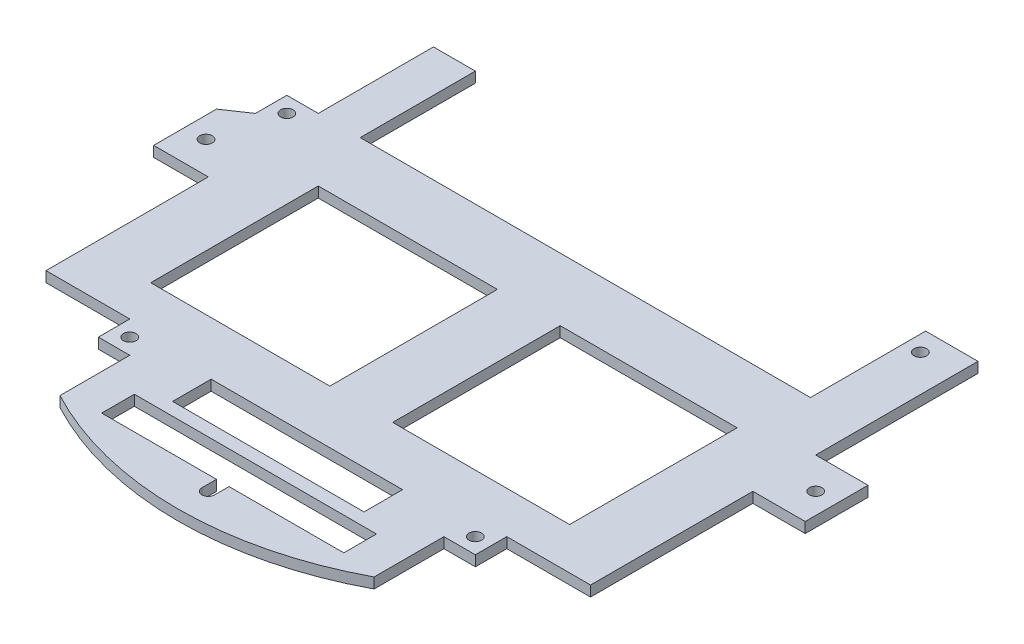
ISO-10303-21;
HEADER;
FILE_DESCRIPTION(('STEP AP214'),'2;1');
FILE_NAME('part.step','',(''),(''),'','','');
FILE_SCHEMA(('AUTOMOTIVE_DESIGN { 1 0 10303 214 1 1 1 1 }'));
ENDSEC;
DATA;
#1=APPLICATION_CONTEXT('core data for automotive mechanical design processes');
#2=APPLICATION_PROTOCOL_DEFINITION('international standard','automotive_design',2000,#1);
#3=PRODUCT_CONTEXT('',#1,'mechanical');
#4=PRODUCT('Part','Part','',(#3));
#5=PRODUCT_RELATED_PRODUCT_CATEGORY('part','',(#4));
#6=PRODUCT_DEFINITION_FORMATION('','',#4);
#7=PRODUCT_DEFINITION_CONTEXT('part definition',#1,'design');
#8=PRODUCT_DEFINITION('design','',#6,#7);
#9=PRODUCT_DEFINITION_SHAPE('','',#8);
#10=(LENGTH_UNIT() NAMED_UNIT(*) SI_UNIT(.MILLI.,.METRE.));
#11=(NAMED_UNIT(*) PLANE_ANGLE_UNIT() SI_UNIT($,.RADIAN.));
#12=(NAMED_UNIT(*) SI_UNIT($,.STERADIAN.) SOLID_ANGLE_UNIT());
#13=UNCERTAINTY_MEASURE_WITH_UNIT(LENGTH_MEASURE(1.E-05),#10,'distance_accuracy_value','');
#14=(GEOMETRIC_REPRESENTATION_CONTEXT(3) GLOBAL_UNCERTAINTY_ASSIGNED_CONTEXT((#13)) GLOBAL_UNIT_ASSIGNED_CONTEXT((#10,
#11,#12)) REPRESENTATION_CONTEXT('',''));
#15=CARTESIAN_POINT('',(0.,0.,0.));
#16=DIRECTION('',(0.,0.,1.));
#17=DIRECTION('',(1.,0.,0.));
#18=AXIS2_PLACEMENT_3D('',#15,#16,#17);
#19=CARTESIAN_POINT('',(0.,5.,0.));
#20=DIRECTION('',(0.,1.,0.));
#21=DIRECTION('',(0.,0.,1.));
#22=AXIS2_PLACEMENT_3D('',#19,#20,#21);
#23=PLANE('',#22);
#24=DIRECTION('',(1.,0.,0.));
#25=VECTOR('',#24,1.);
#26=CARTESIAN_POINT('',(15.5205289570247,5.,72.5));
#27=LINE('',#26,#25);
#28=CARTESIAN_POINT('',(15.5205289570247,5.,72.5));
#29=VERTEX_POINT('',#28);
#30=CARTESIAN_POINT('',(100.,5.,72.5));
#31=VERTEX_POINT('',#30);
#32=EDGE_CURVE('E366',#29,#31,#27,.T.);
#33=ORIENTED_EDGE('',*,*,#32,.F.);
#34=DIRECTION('',(0.,0.,1.));
#35=VECTOR('',#34,1.);
#36=CARTESIAN_POINT('',(15.5205289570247,5.,-7.50000000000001));
#37=LINE('',#36,#35);
#38=CARTESIAN_POINT('',(15.5205289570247,5.,-7.50000000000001));
#39=VERTEX_POINT('',#38);
#40=EDGE_CURVE('E364',#39,#29,#37,.T.);
#41=ORIENTED_EDGE('',*,*,#40,.F.);
#42=DIRECTION('',(-1.,0.,0.));
#43=VECTOR('',#42,1.);
#44=CARTESIAN_POINT('',(15.5205289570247,5.,-7.50000000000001));
#45=LINE('',#44,#43);
#46=CARTESIAN_POINT('',(100.,5.,-7.50000000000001));
#47=VERTEX_POINT('',#46);
#48=EDGE_CURVE('E372',#47,#39,#45,.T.);
#49=ORIENTED_EDGE('',*,*,#48,.F.);
#50=DIRECTION('',(0.,0.,-1.));
#51=VECTOR('',#50,1.);
#52=CARTESIAN_POINT('',(100.,5.,-7.50000000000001));
#53=LINE('',#52,#51);
#54=EDGE_CURVE('E369',#31,#47,#53,.T.);
#55=ORIENTED_EDGE('',*,*,#54,.F.);
#56=EDGE_LOOP('',(#33,#41,#49,#55));
#57=FACE_BOUND('',#56,.T.);
#58=CARTESIAN_POINT('',(145.,5.,0.));
#59=DIRECTION('',(0.,1.,0.));
#60=DIRECTION('',(0.,0.,1.));
#61=AXIS2_PLACEMENT_3D('',#58,#59,#60);
#62=CIRCLE('',#61,2.99999999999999);
#63=CARTESIAN_POINT('',(145.,5.,2.99999999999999));
#64=VERTEX_POINT('',#63);
#65=EDGE_CURVE('E426',#64,#64,#62,.T.);
#66=ORIENTED_EDGE('',*,*,#65,.F.);
#67=EDGE_LOOP('',(#66));
#68=FACE_BOUND('',#67,.T.);
#69=CARTESIAN_POINT('',(82.5,5.,100.));
#70=DIRECTION('',(0.,1.,0.));
#71=DIRECTION('',(0.,0.,1.));
#72=AXIS2_PLACEMENT_3D('',#69,#70,#71);
#73=CIRCLE('',#72,3.00000000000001);
#74=CARTESIAN_POINT('',(82.5,5.,103.));
#75=VERTEX_POINT('',#74);
#76=EDGE_CURVE('E438',#75,#75,#73,.T.);
#77=ORIENTED_EDGE('',*,*,#76,.F.);
#78=EDGE_LOOP('',(#77));
#79=FACE_BOUND('',#78,.T.);
#80=CARTESIAN_POINT('',(-137.5,5.,-29.9999999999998));
#81=DIRECTION('',(0.,1.,0.));
#82=DIRECTION('',(0.,0.,1.));
#83=AXIS2_PLACEMENT_3D('',#80,#81,#82);
#84=CIRCLE('',#83,2.99999999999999);
#85=CARTESIAN_POINT('',(-137.5,5.,-26.9999999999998));
#86=VERTEX_POINT('',#85);
#87=EDGE_CURVE('E450',#86,#86,#84,.T.);
#88=ORIENTED_EDGE('',*,*,#87,.F.);
#89=EDGE_LOOP('',(#88));
#90=FACE_BOUND('',#89,.T.);
#91=DIRECTION('',(0.,0.,-1.));
#92=VECTOR('',#91,1.);
#93=CARTESIAN_POINT('',(3.00000000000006,5.,145.0269592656));
#94=LINE('',#93,#92);
#95=CARTESIAN_POINT('',(3.00000000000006,5.,145.0269592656));
#96=VERTEX_POINT('',#95);
#97=CARTESIAN_POINT('',(3.00000000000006,5.,138.110637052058));
#98=VERTEX_POINT('',#97);
#99=EDGE_CURVE('E464',#96,#98,#94,.T.);
#100=ORIENTED_EDGE('',*,*,#99,.F.);
#101=CARTESIAN_POINT('',(0.,5.,145.0269592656));
#102=DIRECTION('',(0.,1.,0.));
#103=DIRECTION('',(0.,0.,1.));
#104=AXIS2_PLACEMENT_3D('',#101,#102,#103);
#105=CIRCLE('',#104,3.);
#106=CARTESIAN_POINT('',(-2.99999999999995,5.,145.0269592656));
#107=VERTEX_POINT('',#106);
#108=EDGE_CURVE('E462',#107,#96,#105,.T.);
#109=ORIENTED_EDGE('',*,*,#108,.F.);
#110=DIRECTION('',(0.,0.,1.));
#111=VECTOR('',#110,1.);
#112=CARTESIAN_POINT('',(-2.99999999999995,5.,145.0269592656));
#113=LINE('',#112,#111);
#114=CARTESIAN_POINT('',(-2.99999999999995,5.,138.110637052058));
#115=VERTEX_POINT('',#114);
#116=EDGE_CURVE('E478',#115,#107,#113,.T.);
#117=ORIENTED_EDGE('',*,*,#116,.F.);
#118=DIRECTION('',(1.,0.,0.));
#119=VECTOR('',#118,1.);
#120=CARTESIAN_POINT('',(-57.8,5.,138.110637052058));
#121=LINE('',#120,#119);
#122=CARTESIAN_POINT('',(-57.8,5.,138.110637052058));
#123=VERTEX_POINT('',#122);
#124=EDGE_CURVE('E475',#123,#115,#121,.T.);
#125=ORIENTED_EDGE('',*,*,#124,.F.);
#126=DIRECTION('',(0.,0.,1.));
#127=VECTOR('',#126,1.);
#128=CARTESIAN_POINT('',(-57.8,5.,122.510637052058));
#129=LINE('',#128,#127);
#130=CARTESIAN_POINT('',(-57.8,5.,122.510637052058));
#131=VERTEX_POINT('',#130);
#132=EDGE_CURVE('E473',#131,#123,#129,.T.);
#133=ORIENTED_EDGE('',*,*,#132,.F.);
#134=DIRECTION('',(-1.,0.,0.));
#135=VECTOR('',#134,1.);
#136=CARTESIAN_POINT('',(57.8,5.,122.510637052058));
#137=LINE('',#136,#135);
#138=CARTESIAN_POINT('',(57.8,5.,122.510637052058));
#139=VERTEX_POINT('',#138);
#140=EDGE_CURVE('E471',#139,#131,#137,.T.);
#141=ORIENTED_EDGE('',*,*,#140,.F.);
#142=DIRECTION('',(0.,0.,-1.));
#143=VECTOR('',#142,1.);
#144=CARTESIAN_POINT('',(57.8,5.,138.110637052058));
#145=LINE('',#144,#143);
#146=CARTESIAN_POINT('',(57.8,5.,138.110637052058));
#147=VERTEX_POINT('',#146);
#148=EDGE_CURVE('E469',#147,#139,#145,.T.);
#149=ORIENTED_EDGE('',*,*,#148,.F.);
#150=DIRECTION('',(1.,0.,0.));
#151=VECTOR('',#150,1.);
#152=CARTESIAN_POINT('',(3.00000000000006,5.,138.110637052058));
#153=LINE('',#152,#151);
#154=EDGE_CURVE('E467',#98,#147,#153,.T.);
#155=ORIENTED_EDGE('',*,*,#154,.F.);
#156=EDGE_LOOP('',(#100,#109,#117,#125,#133,#141,#149,#155));
#157=FACE_BOUND('',#156,.T.);
#158=DIRECTION('',(0.,0.,1.));
#159=VECTOR('',#158,1.);
#160=CARTESIAN_POINT('',(-130.,5.,-92.5));
#161=LINE('',#160,#159);
#162=CARTESIAN_POINT('',(-130.,5.,-92.5));
#163=VERTEX_POINT('',#162);
#164=CARTESIAN_POINT('',(-130.,5.,-37.4999999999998));
#165=VERTEX_POINT('',#164);
#166=EDGE_CURVE('E521',#163,#165,#161,.T.);
#167=ORIENTED_EDGE('',*,*,#166,.T.);
#168=DIRECTION('',(-1.,0.,0.));
#169=VECTOR('',#168,1.);
#170=CARTESIAN_POINT('',(-130.,5.,-37.4999999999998));
#171=LINE('',#170,#169);
#172=CARTESIAN_POINT('',(-145.,5.,-37.4999999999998));
#173=VERTEX_POINT('',#172);
#174=EDGE_CURVE('E524',#165,#173,#171,.T.);
#175=ORIENTED_EDGE('',*,*,#174,.T.);
#176=DIRECTION('',(0.,0.,1.));
#177=VECTOR('',#176,1.);
#178=CARTESIAN_POINT('',(-145.,5.,-37.4999999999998));
#179=LINE('',#178,#177);
#180=CARTESIAN_POINT('',(-145.,5.,-22.4999999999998));
#181=VERTEX_POINT('',#180);
#182=EDGE_CURVE('E527',#173,#181,#179,.T.);
#183=ORIENTED_EDGE('',*,*,#182,.T.);
#184=DIRECTION('',(-0.828305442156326,0.,0.560276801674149));
#185=VECTOR('',#184,1.);
#186=CARTESIAN_POINT('',(-156.08789583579,5.,-15.));
#187=LINE('',#186,#185);
#188=CARTESIAN_POINT('',(-156.08789583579,5.,-15.));
#189=VERTEX_POINT('',#188);
#190=EDGE_CURVE('E529',#181,#189,#187,.T.);
#191=ORIENTED_EDGE('',*,*,#190,.T.);
#192=DIRECTION('',(0.,0.,1.));
#193=VECTOR('',#192,1.);
#194=CARTESIAN_POINT('',(-156.08789583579,5.,15.));
#195=LINE('',#194,#193);
#196=CARTESIAN_POINT('',(-156.08789583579,5.,15.));
#197=VERTEX_POINT('',#196);
#198=EDGE_CURVE('E531',#189,#197,#195,.T.);
#199=ORIENTED_EDGE('',*,*,#198,.T.);
#200=DIRECTION('',(1.,0.,0.));
#201=VECTOR('',#200,1.);
#202=CARTESIAN_POINT('',(-156.08789583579,5.,15.));
#203=LINE('',#202,#201);
#204=CARTESIAN_POINT('',(-130.,5.,15.));
#205=VERTEX_POINT('',#204);
#206=EDGE_CURVE('E533',#197,#205,#203,.T.);
#207=ORIENTED_EDGE('',*,*,#206,.T.);
#208=DIRECTION('',(0.,0.,1.));
#209=VECTOR('',#208,1.);
#210=CARTESIAN_POINT('',(-130.,5.,15.));
#211=LINE('',#210,#209);
#212=CARTESIAN_POINT('',(-130.,5.,92.5));
#213=VERTEX_POINT('',#212);
#214=EDGE_CURVE('E535',#205,#213,#211,.T.);
#215=ORIENTED_EDGE('',*,*,#214,.T.);
#216=DIRECTION('',(1.,0.,0.));
#217=VECTOR('',#216,1.);
#218=CARTESIAN_POINT('',(-130.,5.,92.5));
#219=LINE('',#218,#217);
#220=CARTESIAN_POINT('',(-90.,5.,92.5));
#221=VERTEX_POINT('',#220);
#222=EDGE_CURVE('E537',#213,#221,#219,.T.);
#223=ORIENTED_EDGE('',*,*,#222,.T.);
#224=DIRECTION('',(0.,0.,1.));
#225=VECTOR('',#224,1.);
#226=CARTESIAN_POINT('',(-90.,5.,92.5));
#227=LINE('',#226,#225);
#228=CARTESIAN_POINT('',(-90.,5.,107.5));
#229=VERTEX_POINT('',#228);
#230=EDGE_CURVE('E539',#221,#229,#227,.T.);
#231=ORIENTED_EDGE('',*,*,#230,.T.);
#232=DIRECTION('',(1.,0.,0.));
#233=VECTOR('',#232,1.);
#234=CARTESIAN_POINT('',(-90.,5.,107.5));
#235=LINE('',#234,#233);
#236=CARTESIAN_POINT('',(-75.,5.,107.5));
#237=VERTEX_POINT('',#236);
#238=EDGE_CURVE('E541',#229,#237,#235,.T.);
#239=ORIENTED_EDGE('',*,*,#238,.T.);
#240=DIRECTION('',(0.,0.,1.));
#241=VECTOR('',#240,1.);
#242=CARTESIAN_POINT('',(-75.,5.,140.823471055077));
#243=LINE('',#242,#241);
#244=CARTESIAN_POINT('',(-75.,5.,140.823471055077));
#245=VERTEX_POINT('',#244);
#246=EDGE_CURVE('E543',#237,#245,#243,.T.);
#247=ORIENTED_EDGE('',*,*,#246,.T.);
#248=CARTESIAN_POINT('',(0.,5.,0.));
#249=DIRECTION('',(0.,1.,0.));
#250=DIRECTION('',(0.,0.,1.));
#251=AXIS2_PLACEMENT_3D('',#248,#249,#250);
#252=CIRCLE('',#251,159.550148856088);
#253=CARTESIAN_POINT('',(75.,5.,140.823471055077));
#254=VERTEX_POINT('',#253);
#255=EDGE_CURVE('E545',#245,#254,#252,.T.);
#256=ORIENTED_EDGE('',*,*,#255,.T.);
#257=DIRECTION('',(0.,0.,-1.));
#258=VECTOR('',#257,1.);
#259=CARTESIAN_POINT('',(75.,5.,140.823471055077));
#260=LINE('',#259,#258);
#261=CARTESIAN_POINT('',(75.,5.,107.5));
#262=VERTEX_POINT('',#261);
#263=EDGE_CURVE('E547',#254,#262,#260,.T.);
#264=ORIENTED_EDGE('',*,*,#263,.T.);
#265=DIRECTION('',(1.,0.,0.));
#266=VECTOR('',#265,1.);
#267=CARTESIAN_POINT('',(90.,5.,107.5));
#268=LINE('',#267,#266);
#269=CARTESIAN_POINT('',(90.,5.,107.5));
#270=VERTEX_POINT('',#269);
#271=EDGE_CURVE('E549',#262,#270,#268,.T.);
#272=ORIENTED_EDGE('',*,*,#271,.T.);
#273=DIRECTION('',(0.,0.,-1.));
#274=VECTOR('',#273,1.);
#275=CARTESIAN_POINT('',(90.,5.,92.5));
#276=LINE('',#275,#274);
#277=CARTESIAN_POINT('',(90.,5.,92.5));
#278=VERTEX_POINT('',#277);
#279=EDGE_CURVE('E551',#270,#278,#276,.T.);
#280=ORIENTED_EDGE('',*,*,#279,.T.);
#281=DIRECTION('',(1.,0.,0.));
#282=VECTOR('',#281,1.);
#283=CARTESIAN_POINT('',(90.,5.,92.5));
#284=LINE('',#283,#282);
#285=CARTESIAN_POINT('',(130.,5.,92.5));
#286=VERTEX_POINT('',#285);
#287=EDGE_CURVE('E553',#278,#286,#284,.T.);
#288=ORIENTED_EDGE('',*,*,#287,.T.);
#289=DIRECTION('',(0.,0.,-1.));
#290=VECTOR('',#289,1.);
#291=CARTESIAN_POINT('',(130.,5.,92.5));
#292=LINE('',#291,#290);
#293=CARTESIAN_POINT('',(130.,5.,15.));
#294=VERTEX_POINT('',#293);
#295=EDGE_CURVE('E555',#286,#294,#292,.T.);
#296=ORIENTED_EDGE('',*,*,#295,.T.);
#297=DIRECTION('',(1.,0.,0.));
#298=VECTOR('',#297,1.);
#299=CARTESIAN_POINT('',(155.,5.,15.));
#300=LINE('',#299,#298);
#301=CARTESIAN_POINT('',(155.,5.,15.));
#302=VERTEX_POINT('',#301);
#303=EDGE_CURVE('E557',#294,#302,#300,.T.);
#304=ORIENTED_EDGE('',*,*,#303,.T.);
#305=DIRECTION('',(0.,0.,-1.));
#306=VECTOR('',#305,1.);
#307=CARTESIAN_POINT('',(155.,5.,15.));
#308=LINE('',#307,#306);
#309=CARTESIAN_POINT('',(155.,5.,-15.0000000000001));
#310=VERTEX_POINT('',#309);
#311=EDGE_CURVE('E559',#302,#310,#308,.T.);
#312=ORIENTED_EDGE('',*,*,#311,.T.);
#313=DIRECTION('',(-1.,0.,0.));
#314=VECTOR('',#313,1.);
#315=CARTESIAN_POINT('',(155.,5.,-15.0000000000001));
#316=LINE('',#315,#314);
#317=CARTESIAN_POINT('',(130.,5.,-15.0000000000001));
#318=VERTEX_POINT('',#317);
#319=EDGE_CURVE('E561',#310,#318,#316,.T.);
#320=ORIENTED_EDGE('',*,*,#319,.T.);
#321=DIRECTION('',(0.,0.,-1.));
#322=VECTOR('',#321,1.);
#323=CARTESIAN_POINT('',(130.,5.,-15.0000000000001));
#324=LINE('',#323,#322);
#325=CARTESIAN_POINT('',(130.,5.,-92.5));
#326=VERTEX_POINT('',#325);
#327=EDGE_CURVE('E563',#318,#326,#324,.T.);
#328=ORIENTED_EDGE('',*,*,#327,.T.);
#329=DIRECTION('',(-1.,0.,0.));
#330=VECTOR('',#329,1.);
#331=CARTESIAN_POINT('',(105.,5.,-92.4999999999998));
#332=LINE('',#331,#330);
#333=CARTESIAN_POINT('',(105.,5.,-92.4999999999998));
#334=VERTEX_POINT('',#333);
#335=EDGE_CURVE('E565',#326,#334,#332,.T.);
#336=ORIENTED_EDGE('',*,*,#335,.T.);
#337=DIRECTION('',(0.,0.,1.));
#338=VECTOR('',#337,1.);
#339=CARTESIAN_POINT('',(105.,5.,-92.4999999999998));
#340=LINE('',#339,#338);
#341=CARTESIAN_POINT('',(105.,5.,-37.5));
#342=VERTEX_POINT('',#341);
#343=EDGE_CURVE('E567',#334,#342,#340,.T.);
#344=ORIENTED_EDGE('',*,*,#343,.T.);
#345=DIRECTION('',(-1.,0.,0.));
#346=VECTOR('',#345,1.);
#347=CARTESIAN_POINT('',(105.,5.,-37.5));
#348=LINE('',#347,#346);
#349=CARTESIAN_POINT('',(-110.,5.,-37.5));
#350=VERTEX_POINT('',#349);
#351=EDGE_CURVE('E569',#342,#350,#348,.T.);
#352=ORIENTED_EDGE('',*,*,#351,.T.);
#353=DIRECTION('',(0.,0.,-1.));
#354=VECTOR('',#353,1.);
#355=CARTESIAN_POINT('',(-110.,5.,-62.6177056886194));
#356=LINE('',#355,#354);
#357=CARTESIAN_POINT('',(-110.,5.,-92.5));
#358=VERTEX_POINT('',#357);
#359=EDGE_CURVE('E571',#350,#358,#356,.T.);
#360=ORIENTED_EDGE('',*,*,#359,.T.);
#361=DIRECTION('',(-1.,0.,0.));
#362=VECTOR('',#361,1.);
#363=CARTESIAN_POINT('',(-130.,5.,-92.5));
#364=LINE('',#363,#362);
#365=EDGE_CURVE('E573',#358,#163,#364,.T.);
#366=ORIENTED_EDGE('',*,*,#365,.T.);
#367=EDGE_LOOP('',(#167,#175,#183,#191,#199,#207,#215,#223,#231,#239,#247,#256,#264,#272,#280,
#288,#296,#304,#312,#320,#328,#336,#344,#352,#360,#366));
#368=FACE_BOUND('',#367,.T.);
#369=CARTESIAN_POINT('',(112.5,5.,-82.5000000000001));
#370=DIRECTION('',(0.,1.,0.));
#371=DIRECTION('',(0.,0.,1.));
#372=AXIS2_PLACEMENT_3D('',#369,#370,#371);
#373=CIRCLE('',#372,3.00000000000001);
#374=CARTESIAN_POINT('',(112.5,5.,-79.5000000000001));
#375=VERTEX_POINT('',#374);
#376=EDGE_CURVE('E456',#375,#375,#373,.T.);
#377=ORIENTED_EDGE('',*,*,#376,.F.);
#378=EDGE_LOOP('',(#377));
#379=FACE_BOUND('',#378,.T.);
#380=CARTESIAN_POINT('',(-146.08789583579,5.,0.));
#381=DIRECTION('',(0.,1.,0.));
#382=DIRECTION('',(0.,0.,1.));
#383=AXIS2_PLACEMENT_3D('',#380,#381,#382);
#384=CIRCLE('',#383,2.99999999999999);
#385=CARTESIAN_POINT('',(-146.08789583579,5.,3.00000000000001));
#386=VERTEX_POINT('',#385);
#387=EDGE_CURVE('E444',#386,#386,#384,.T.);
#388=ORIENTED_EDGE('',*,*,#387,.F.);
#389=EDGE_LOOP('',(#388));
#390=FACE_BOUND('',#389,.T.);
#391=CARTESIAN_POINT('',(-82.5,5.,100.));
#392=DIRECTION('',(0.,1.,0.));
#393=DIRECTION('',(0.,0.,1.));
#394=AXIS2_PLACEMENT_3D('',#391,#392,#393);
#395=CIRCLE('',#394,3.00000000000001);
#396=CARTESIAN_POINT('',(-82.5,5.,103.));
#397=VERTEX_POINT('',#396);
#398=EDGE_CURVE('E432',#397,#397,#395,.T.);
#399=ORIENTED_EDGE('',*,*,#398,.F.);
#400=EDGE_LOOP('',(#399));
#401=FACE_BOUND('',#400,.T.);
#402=DIRECTION('',(0.,0.,1.));
#403=VECTOR('',#402,1.);
#404=CARTESIAN_POINT('',(-100.,5.,-7.50000000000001));
#405=LINE('',#404,#403);
#406=CARTESIAN_POINT('',(-100.,5.,-7.50000000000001));
#407=VERTEX_POINT('',#406);
#408=CARTESIAN_POINT('',(-100.,5.,72.5));
#409=VERTEX_POINT('',#408);
#410=EDGE_CURVE('E397',#407,#409,#405,.T.);
#411=ORIENTED_EDGE('',*,*,#410,.F.);
#412=DIRECTION('',(-1.,0.,0.));
#413=VECTOR('',#412,1.);
#414=CARTESIAN_POINT('',(-100.,5.,-7.50000000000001));
#415=LINE('',#414,#413);
#416=CARTESIAN_POINT('',(-14.4794710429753,5.,-7.50000000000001));
#417=VERTEX_POINT('',#416);
#418=EDGE_CURVE('E395',#417,#407,#415,.T.);
#419=ORIENTED_EDGE('',*,*,#418,.F.);
#420=DIRECTION('',(0.,0.,-1.));
#421=VECTOR('',#420,1.);
#422=CARTESIAN_POINT('',(-14.4794710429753,5.,-7.50000000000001));
#423=LINE('',#422,#421);
#424=CARTESIAN_POINT('',(-14.4794710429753,5.,72.5));
#425=VERTEX_POINT('',#424);
#426=EDGE_CURVE('E403',#425,#417,#423,.T.);
#427=ORIENTED_EDGE('',*,*,#426,.F.);
#428=DIRECTION('',(1.,0.,0.));
#429=VECTOR('',#428,1.);
#430=CARTESIAN_POINT('',(-100.,5.,72.5));
#431=LINE('',#430,#429);
#432=EDGE_CURVE('E400',#409,#425,#431,.T.);
#433=ORIENTED_EDGE('',*,*,#432,.F.);
#434=EDGE_LOOP('',(#411,#419,#427,#433));
#435=FACE_BOUND('',#434,.T.);
#436=DIRECTION('',(-1.,0.,0.));
#437=VECTOR('',#436,1.);
#438=CARTESIAN_POINT('',(45.7,5.,97.9630212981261));
#439=LINE('',#438,#437);
#440=CARTESIAN_POINT('',(45.7,5.,97.9630212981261));
#441=VERTEX_POINT('',#440);
#442=CARTESIAN_POINT('',(-45.7,5.,97.9630212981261));
#443=VERTEX_POINT('',#442);
#444=EDGE_CURVE('E336',#441,#443,#439,.T.);
#445=ORIENTED_EDGE('',*,*,#444,.F.);
#446=DIRECTION('',(0.,0.,-1.));
#447=VECTOR('',#446,1.);
#448=CARTESIAN_POINT('',(45.7,5.,116.363021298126));
#449=LINE('',#448,#447);
#450=CARTESIAN_POINT('',(45.7,5.,116.363021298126));
#451=VERTEX_POINT('',#450);
#452=EDGE_CURVE('E328',#451,#441,#449,.T.);
#453=ORIENTED_EDGE('',*,*,#452,.F.);
#454=DIRECTION('',(1.,0.,0.));
#455=VECTOR('',#454,1.);
#456=CARTESIAN_POINT('',(-45.7,5.,116.363021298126));
#457=LINE('',#456,#455);
#458=CARTESIAN_POINT('',(-45.7,5.,116.363021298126));
#459=VERTEX_POINT('',#458);
#460=EDGE_CURVE('E350',#459,#451,#457,.T.);
#461=ORIENTED_EDGE('',*,*,#460,.F.);
#462=DIRECTION('',(0.,0.,1.));
#463=VECTOR('',#462,1.);
#464=CARTESIAN_POINT('',(-45.7,5.,97.9630212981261));
#465=LINE('',#464,#463);
#466=EDGE_CURVE('E348',#443,#459,#465,.T.);
#467=ORIENTED_EDGE('',*,*,#466,.F.);
#468=EDGE_LOOP('',(#445,#453,#461,#467));
#469=FACE_BOUND('',#468,.T.);
#470=ADVANCED_FACE('F35',(#57,#68,#79,#90,#157,#368,#379,#390,#401,#435,#469),#23,.T.);
#471=CARTESIAN_POINT('',(0.,0.,0.));
#472=DIRECTION('',(0.,1.,0.));
#473=DIRECTION('',(0.,0.,1.));
#474=AXIS2_PLACEMENT_3D('',#471,#472,#473);
#475=PLANE('',#474);
#476=DIRECTION('',(0.,0.,1.));
#477=VECTOR('',#476,1.);
#478=CARTESIAN_POINT('',(15.5205289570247,0.,-7.50000000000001));
#479=LINE('',#478,#477);
#480=CARTESIAN_POINT('',(15.5205289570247,0.,-7.50000000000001));
#481=VERTEX_POINT('',#480);
#482=CARTESIAN_POINT('',(15.5205289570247,0.,72.5));
#483=VERTEX_POINT('',#482);
#484=EDGE_CURVE('E344',#481,#483,#479,.T.);
#485=ORIENTED_EDGE('',*,*,#484,.T.);
#486=DIRECTION('',(1.,0.,0.));
#487=VECTOR('',#486,1.);
#488=CARTESIAN_POINT('',(15.5205289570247,0.,72.5));
#489=LINE('',#488,#487);
#490=CARTESIAN_POINT('',(100.,0.,72.5));
#491=VERTEX_POINT('',#490);
#492=EDGE_CURVE('E377',#483,#491,#489,.T.);
#493=ORIENTED_EDGE('',*,*,#492,.T.);
#494=DIRECTION('',(0.,0.,-1.));
#495=VECTOR('',#494,1.);
#496=CARTESIAN_POINT('',(100.,0.,-7.50000000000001));
#497=LINE('',#496,#495);
#498=CARTESIAN_POINT('',(100.,0.,-7.50000000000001));
#499=VERTEX_POINT('',#498);
#500=EDGE_CURVE('E380',#491,#499,#497,.T.);
#501=ORIENTED_EDGE('',*,*,#500,.T.);
#502=DIRECTION('',(-1.,0.,0.));
#503=VECTOR('',#502,1.);
#504=CARTESIAN_POINT('',(15.5205289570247,0.,-7.50000000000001));
#505=LINE('',#504,#503);
#506=EDGE_CURVE('E367',#499,#481,#505,.T.);
#507=ORIENTED_EDGE('',*,*,#506,.T.);
#508=EDGE_LOOP('',(#485,#493,#501,#507));
#509=FACE_BOUND('',#508,.T.);
#510=CARTESIAN_POINT('',(145.,0.,0.));
#511=DIRECTION('',(0.,1.,0.));
#512=DIRECTION('',(0.,0.,1.));
#513=AXIS2_PLACEMENT_3D('',#510,#511,#512);
#514=CIRCLE('',#513,2.99999999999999);
#515=CARTESIAN_POINT('',(145.,0.,2.99999999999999));
#516=VERTEX_POINT('',#515);
#517=EDGE_CURVE('E425',#516,#516,#514,.T.);
#518=ORIENTED_EDGE('',*,*,#517,.T.);
#519=EDGE_LOOP('',(#518));
#520=FACE_BOUND('',#519,.T.);
#521=CARTESIAN_POINT('',(82.5,0.,100.));
#522=DIRECTION('',(0.,1.,0.));
#523=DIRECTION('',(0.,0.,1.));
#524=AXIS2_PLACEMENT_3D('',#521,#522,#523);
#525=CIRCLE('',#524,3.00000000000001);
#526=CARTESIAN_POINT('',(82.5,0.,103.));
#527=VERTEX_POINT('',#526);
#528=EDGE_CURVE('E435',#527,#527,#525,.T.);
#529=ORIENTED_EDGE('',*,*,#528,.T.);
#530=EDGE_LOOP('',(#529));
#531=FACE_BOUND('',#530,.T.);
#532=CARTESIAN_POINT('',(-137.5,0.,-29.9999999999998));
#533=DIRECTION('',(0.,1.,0.));
#534=DIRECTION('',(0.,0.,1.));
#535=AXIS2_PLACEMENT_3D('',#532,#533,#534);
#536=CIRCLE('',#535,2.99999999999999);
#537=CARTESIAN_POINT('',(-137.5,0.,-26.9999999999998));
#538=VERTEX_POINT('',#537);
#539=EDGE_CURVE('E447',#538,#538,#536,.T.);
#540=ORIENTED_EDGE('',*,*,#539,.T.);
#541=EDGE_LOOP('',(#540));
#542=FACE_BOUND('',#541,.T.);
#543=CARTESIAN_POINT('',(0.,0.,145.0269592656));
#544=DIRECTION('',(0.,1.,0.));
#545=DIRECTION('',(0.,0.,1.));
#546=AXIS2_PLACEMENT_3D('',#543,#544,#545);
#547=CIRCLE('',#546,3.);
#548=CARTESIAN_POINT('',(-2.99999999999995,0.,145.0269592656));
#549=VERTEX_POINT('',#548);
#550=CARTESIAN_POINT('',(3.00000000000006,0.,145.0269592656));
#551=VERTEX_POINT('',#550);
#552=EDGE_CURVE('E459',#549,#551,#547,.T.);
#553=ORIENTED_EDGE('',*,*,#552,.T.);
#554=DIRECTION('',(0.,0.,-1.));
#555=VECTOR('',#554,1.);
#556=CARTESIAN_POINT('',(3.00000000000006,0.,145.0269592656));
#557=LINE('',#556,#555);
#558=CARTESIAN_POINT('',(3.00000000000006,0.,138.110637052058));
#559=VERTEX_POINT('',#558);
#560=EDGE_CURVE('E483',#551,#559,#557,.T.);
#561=ORIENTED_EDGE('',*,*,#560,.T.);
#562=DIRECTION('',(1.,0.,0.));
#563=VECTOR('',#562,1.);
#564=CARTESIAN_POINT('',(3.00000000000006,0.,138.110637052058));
#565=LINE('',#564,#563);
#566=CARTESIAN_POINT('',(57.8,0.,138.110637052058));
#567=VERTEX_POINT('',#566);
#568=EDGE_CURVE('E486',#559,#567,#565,.T.);
#569=ORIENTED_EDGE('',*,*,#568,.T.);
#570=DIRECTION('',(0.,0.,-1.));
#571=VECTOR('',#570,1.);
#572=CARTESIAN_POINT('',(57.8,0.,138.110637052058));
#573=LINE('',#572,#571);
#574=CARTESIAN_POINT('',(57.8,0.,122.510637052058));
#575=VERTEX_POINT('',#574);
#576=EDGE_CURVE('E489',#567,#575,#573,.T.);
#577=ORIENTED_EDGE('',*,*,#576,.T.);
#578=DIRECTION('',(-1.,0.,0.));
#579=VECTOR('',#578,1.);
#580=CARTESIAN_POINT('',(57.8,0.,122.510637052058));
#581=LINE('',#580,#579);
#582=CARTESIAN_POINT('',(-57.8,0.,122.510637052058));
#583=VERTEX_POINT('',#582);
#584=EDGE_CURVE('E492',#575,#583,#581,.T.);
#585=ORIENTED_EDGE('',*,*,#584,.T.);
#586=DIRECTION('',(0.,0.,1.));
#587=VECTOR('',#586,1.);
#588=CARTESIAN_POINT('',(-57.8,0.,122.510637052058));
#589=LINE('',#588,#587);
#590=CARTESIAN_POINT('',(-57.8,0.,138.110637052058));
#591=VERTEX_POINT('',#590);
#592=EDGE_CURVE('E495',#583,#591,#589,.T.);
#593=ORIENTED_EDGE('',*,*,#592,.T.);
#594=DIRECTION('',(1.,0.,0.));
#595=VECTOR('',#594,1.);
#596=CARTESIAN_POINT('',(-57.8,0.,138.110637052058));
#597=LINE('',#596,#595);
#598=CARTESIAN_POINT('',(-2.99999999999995,0.,138.110637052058));
#599=VERTEX_POINT('',#598);
#600=EDGE_CURVE('E498',#591,#599,#597,.T.);
#601=ORIENTED_EDGE('',*,*,#600,.T.);
#602=DIRECTION('',(0.,0.,1.));
#603=VECTOR('',#602,1.);
#604=CARTESIAN_POINT('',(-2.99999999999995,0.,145.0269592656));
#605=LINE('',#604,#603);
#606=EDGE_CURVE('E465',#599,#549,#605,.T.);
#607=ORIENTED_EDGE('',*,*,#606,.T.);
#608=EDGE_LOOP('',(#553,#561,#569,#577,#585,#593,#601,#607));
#609=FACE_BOUND('',#608,.T.);
#610=DIRECTION('',(0.,0.,1.));
#611=VECTOR('',#610,1.);
#612=CARTESIAN_POINT('',(-130.,0.,-92.5));
#613=LINE('',#612,#611);
#614=CARTESIAN_POINT('',(-130.,0.,-92.5));
#615=VERTEX_POINT('',#614);
#616=CARTESIAN_POINT('',(-130.,0.,-37.4999999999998));
#617=VERTEX_POINT('',#616);
#618=EDGE_CURVE('E520',#615,#617,#613,.T.);
#619=ORIENTED_EDGE('',*,*,#618,.F.);
#620=DIRECTION('',(-1.,0.,0.));
#621=VECTOR('',#620,1.);
#622=CARTESIAN_POINT('',(-130.,0.,-92.5));
#623=LINE('',#622,#621);
#624=CARTESIAN_POINT('',(-110.,0.,-92.5));
#625=VERTEX_POINT('',#624);
#626=EDGE_CURVE('E525',#625,#615,#623,.T.);
#627=ORIENTED_EDGE('',*,*,#626,.F.);
#628=DIRECTION('',(0.,0.,-1.));
#629=VECTOR('',#628,1.);
#630=CARTESIAN_POINT('',(-110.,0.,-92.5));
#631=LINE('',#630,#629);
#632=CARTESIAN_POINT('',(-110.,0.,-37.5));
#633=VERTEX_POINT('',#632);
#634=EDGE_CURVE('E628',#633,#625,#631,.T.);
#635=ORIENTED_EDGE('',*,*,#634,.F.);
#636=DIRECTION('',(-1.,0.,0.));
#637=VECTOR('',#636,1.);
#638=CARTESIAN_POINT('',(-110.,0.,-37.5));
#639=LINE('',#638,#637);
#640=CARTESIAN_POINT('',(105.,0.,-37.5));
#641=VERTEX_POINT('',#640);
#642=EDGE_CURVE('E625',#641,#633,#639,.T.);
#643=ORIENTED_EDGE('',*,*,#642,.F.);
#644=DIRECTION('',(0.,0.,1.));
#645=VECTOR('',#644,1.);
#646=CARTESIAN_POINT('',(105.,0.,-57.5));
#647=LINE('',#646,#645);
#648=CARTESIAN_POINT('',(105.,0.,-92.4999999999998));
#649=VERTEX_POINT('',#648);
#650=EDGE_CURVE('E622',#649,#641,#647,.T.);
#651=ORIENTED_EDGE('',*,*,#650,.F.);
#652=DIRECTION('',(-1.,0.,0.));
#653=VECTOR('',#652,1.);
#654=CARTESIAN_POINT('',(105.,0.,-92.4999999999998));
#655=LINE('',#654,#653);
#656=CARTESIAN_POINT('',(130.,0.,-92.5));
#657=VERTEX_POINT('',#656);
#658=EDGE_CURVE('E619',#657,#649,#655,.T.);
#659=ORIENTED_EDGE('',*,*,#658,.F.);
#660=DIRECTION('',(0.,0.,-1.));
#661=VECTOR('',#660,1.);
#662=CARTESIAN_POINT('',(130.,0.,-92.5));
#663=LINE('',#662,#661);
#664=CARTESIAN_POINT('',(130.,0.,-15.0000000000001));
#665=VERTEX_POINT('',#664);
#666=EDGE_CURVE('E617',#665,#657,#663,.T.);
#667=ORIENTED_EDGE('',*,*,#666,.F.);
#668=DIRECTION('',(-1.,0.,0.));
#669=VECTOR('',#668,1.);
#670=CARTESIAN_POINT('',(155.,0.,-15.0000000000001));
#671=LINE('',#670,#669);
#672=CARTESIAN_POINT('',(155.,0.,-15.0000000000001));
#673=VERTEX_POINT('',#672);
#674=EDGE_CURVE('E614',#673,#665,#671,.T.);
#675=ORIENTED_EDGE('',*,*,#674,.F.);
#676=DIRECTION('',(0.,0.,-1.));
#677=VECTOR('',#676,1.);
#678=CARTESIAN_POINT('',(155.,0.,15.));
#679=LINE('',#678,#677);
#680=CARTESIAN_POINT('',(155.,0.,15.));
#681=VERTEX_POINT('',#680);
#682=EDGE_CURVE('E612',#681,#673,#679,.T.);
#683=ORIENTED_EDGE('',*,*,#682,.F.);
#684=DIRECTION('',(1.,0.,0.));
#685=VECTOR('',#684,1.);
#686=CARTESIAN_POINT('',(155.,0.,15.));
#687=LINE('',#686,#685);
#688=CARTESIAN_POINT('',(130.,0.,15.));
#689=VERTEX_POINT('',#688);
#690=EDGE_CURVE('E610',#689,#681,#687,.T.);
#691=ORIENTED_EDGE('',*,*,#690,.F.);
#692=DIRECTION('',(0.,0.,-1.));
#693=VECTOR('',#692,1.);
#694=CARTESIAN_POINT('',(130.,0.,92.5));
#695=LINE('',#694,#693);
#696=CARTESIAN_POINT('',(130.,0.,92.5));
#697=VERTEX_POINT('',#696);
#698=EDGE_CURVE('E608',#697,#689,#695,.T.);
#699=ORIENTED_EDGE('',*,*,#698,.F.);
#700=DIRECTION('',(1.,0.,0.));
#701=VECTOR('',#700,1.);
#702=CARTESIAN_POINT('',(90.,0.,92.5));
#703=LINE('',#702,#701);
#704=CARTESIAN_POINT('',(90.,0.,92.5));
#705=VERTEX_POINT('',#704);
#706=EDGE_CURVE('E606',#705,#697,#703,.T.);
#707=ORIENTED_EDGE('',*,*,#706,.F.);
#708=DIRECTION('',(0.,0.,-1.));
#709=VECTOR('',#708,1.);
#710=CARTESIAN_POINT('',(90.,0.,92.5));
#711=LINE('',#710,#709);
#712=CARTESIAN_POINT('',(90.,0.,107.5));
#713=VERTEX_POINT('',#712);
#714=EDGE_CURVE('E604',#713,#705,#711,.T.);
#715=ORIENTED_EDGE('',*,*,#714,.F.);
#716=DIRECTION('',(1.,0.,0.));
#717=VECTOR('',#716,1.);
#718=CARTESIAN_POINT('',(90.,0.,107.5));
#719=LINE('',#718,#717);
#720=CARTESIAN_POINT('',(75.,0.,107.5));
#721=VERTEX_POINT('',#720);
#722=EDGE_CURVE('E602',#721,#713,#719,.T.);
#723=ORIENTED_EDGE('',*,*,#722,.F.);
#724=DIRECTION('',(0.,0.,-1.));
#725=VECTOR('',#724,1.);
#726=CARTESIAN_POINT('',(75.,0.,140.823471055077));
#727=LINE('',#726,#725);
#728=CARTESIAN_POINT('',(75.,0.,140.823471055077));
#729=VERTEX_POINT('',#728);
#730=EDGE_CURVE('E600',#729,#721,#727,.T.);
#731=ORIENTED_EDGE('',*,*,#730,.F.);
#732=CARTESIAN_POINT('',(0.,0.,0.));
#733=DIRECTION('',(0.,1.,0.));
#734=DIRECTION('',(0.,0.,1.));
#735=AXIS2_PLACEMENT_3D('',#732,#733,#734);
#736=CIRCLE('',#735,159.550148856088);
#737=CARTESIAN_POINT('',(-75.,0.,140.823471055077));
#738=VERTEX_POINT('',#737);
#739=EDGE_CURVE('E598',#738,#729,#736,.T.);
#740=ORIENTED_EDGE('',*,*,#739,.F.);
#741=DIRECTION('',(0.,0.,1.));
#742=VECTOR('',#741,1.);
#743=CARTESIAN_POINT('',(-75.,0.,140.823471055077));
#744=LINE('',#743,#742);
#745=CARTESIAN_POINT('',(-75.,0.,107.5));
#746=VERTEX_POINT('',#745);
#747=EDGE_CURVE('E596',#746,#738,#744,.T.);
#748=ORIENTED_EDGE('',*,*,#747,.F.);
#749=DIRECTION('',(1.,0.,0.));
#750=VECTOR('',#749,1.);
#751=CARTESIAN_POINT('',(-90.,0.,107.5));
#752=LINE('',#751,#750);
#753=CARTESIAN_POINT('',(-90.,0.,107.5));
#754=VERTEX_POINT('',#753);
#755=EDGE_CURVE('E594',#754,#746,#752,.T.);
#756=ORIENTED_EDGE('',*,*,#755,.F.);
#757=DIRECTION('',(0.,0.,1.));
#758=VECTOR('',#757,1.);
#759=CARTESIAN_POINT('',(-90.,0.,92.5));
#760=LINE('',#759,#758);
#761=CARTESIAN_POINT('',(-90.,0.,92.5));
#762=VERTEX_POINT('',#761);
#763=EDGE_CURVE('E592',#762,#754,#760,.T.);
#764=ORIENTED_EDGE('',*,*,#763,.F.);
#765=DIRECTION('',(1.,0.,0.));
#766=VECTOR('',#765,1.);
#767=CARTESIAN_POINT('',(-130.,0.,92.5));
#768=LINE('',#767,#766);
#769=CARTESIAN_POINT('',(-130.,0.,92.5));
#770=VERTEX_POINT('',#769);
#771=EDGE_CURVE('E590',#770,#762,#768,.T.);
#772=ORIENTED_EDGE('',*,*,#771,.F.);
#773=DIRECTION('',(0.,0.,1.));
#774=VECTOR('',#773,1.);
#775=CARTESIAN_POINT('',(-130.,0.,15.));
#776=LINE('',#775,#774);
#777=CARTESIAN_POINT('',(-130.,0.,15.));
#778=VERTEX_POINT('',#777);
#779=EDGE_CURVE('E588',#778,#770,#776,.T.);
#780=ORIENTED_EDGE('',*,*,#779,.F.);
#781=DIRECTION('',(1.,0.,0.));
#782=VECTOR('',#781,1.);
#783=CARTESIAN_POINT('',(-156.08789583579,0.,15.));
#784=LINE('',#783,#782);
#785=CARTESIAN_POINT('',(-156.08789583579,0.,15.));
#786=VERTEX_POINT('',#785);
#787=EDGE_CURVE('E586',#786,#778,#784,.T.);
#788=ORIENTED_EDGE('',*,*,#787,.F.);
#789=DIRECTION('',(0.,0.,1.));
#790=VECTOR('',#789,1.);
#791=CARTESIAN_POINT('',(-156.08789583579,0.,15.));
#792=LINE('',#791,#790);
#793=CARTESIAN_POINT('',(-156.08789583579,0.,-15.));
#794=VERTEX_POINT('',#793);
#795=EDGE_CURVE('E584',#794,#786,#792,.T.);
#796=ORIENTED_EDGE('',*,*,#795,.F.);
#797=DIRECTION('',(-0.828305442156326,0.,0.560276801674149));
#798=VECTOR('',#797,1.);
#799=CARTESIAN_POINT('',(-156.08789583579,0.,-15.));
#800=LINE('',#799,#798);
#801=CARTESIAN_POINT('',(-145.,0.,-22.4999999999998));
#802=VERTEX_POINT('',#801);
#803=EDGE_CURVE('E582',#802,#794,#800,.T.);
#804=ORIENTED_EDGE('',*,*,#803,.F.);
#805=DIRECTION('',(0.,0.,1.));
#806=VECTOR('',#805,1.);
#807=CARTESIAN_POINT('',(-145.,0.,-37.4999999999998));
#808=LINE('',#807,#806);
#809=CARTESIAN_POINT('',(-145.,0.,-37.4999999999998));
#810=VERTEX_POINT('',#809);
#811=EDGE_CURVE('E580',#810,#802,#808,.T.);
#812=ORIENTED_EDGE('',*,*,#811,.F.);
#813=DIRECTION('',(-1.,0.,0.));
#814=VECTOR('',#813,1.);
#815=CARTESIAN_POINT('',(-130.,0.,-37.4999999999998));
#816=LINE('',#815,#814);
#817=EDGE_CURVE('E578',#617,#810,#816,.T.);
#818=ORIENTED_EDGE('',*,*,#817,.F.);
#819=EDGE_LOOP('',(#619,#627,#635,#643,#651,#659,#667,#675,#683,#691,#699,#707,#715,#723,#731,
#740,#748,#756,#764,#772,#780,#788,#796,#804,#812,#818));
#820=FACE_BOUND('',#819,.T.);
#821=CARTESIAN_POINT('',(112.5,0.,-82.5000000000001));
#822=DIRECTION('',(0.,1.,0.));
#823=DIRECTION('',(0.,0.,1.));
#824=AXIS2_PLACEMENT_3D('',#821,#822,#823);
#825=CIRCLE('',#824,3.00000000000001);
#826=CARTESIAN_POINT('',(112.5,0.,-79.5000000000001));
#827=VERTEX_POINT('',#826);
#828=EDGE_CURVE('E453',#827,#827,#825,.T.);
#829=ORIENTED_EDGE('',*,*,#828,.T.);
#830=EDGE_LOOP('',(#829));
#831=FACE_BOUND('',#830,.T.);
#832=CARTESIAN_POINT('',(-146.08789583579,0.,0.));
#833=DIRECTION('',(0.,1.,0.));
#834=DIRECTION('',(0.,0.,1.));
#835=AXIS2_PLACEMENT_3D('',#832,#833,#834);
#836=CIRCLE('',#835,2.99999999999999);
#837=CARTESIAN_POINT('',(-146.08789583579,0.,3.00000000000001));
#838=VERTEX_POINT('',#837);
#839=EDGE_CURVE('E441',#838,#838,#836,.T.);
#840=ORIENTED_EDGE('',*,*,#839,.T.);
#841=EDGE_LOOP('',(#840));
#842=FACE_BOUND('',#841,.T.);
#843=CARTESIAN_POINT('',(-82.5,0.,100.));
#844=DIRECTION('',(0.,1.,0.));
#845=DIRECTION('',(0.,0.,1.));
#846=AXIS2_PLACEMENT_3D('',#843,#844,#845);
#847=CIRCLE('',#846,3.00000000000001);
#848=CARTESIAN_POINT('',(-82.5,0.,103.));
#849=VERTEX_POINT('',#848);
#850=EDGE_CURVE('E429',#849,#849,#847,.T.);
#851=ORIENTED_EDGE('',*,*,#850,.T.);
#852=EDGE_LOOP('',(#851));
#853=FACE_BOUND('',#852,.T.);
#854=DIRECTION('',(-1.,0.,0.));
#855=VECTOR('',#854,1.);
#856=CARTESIAN_POINT('',(-100.,0.,-7.50000000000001));
#857=LINE('',#856,#855);
#858=CARTESIAN_POINT('',(-14.4794710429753,0.,-7.50000000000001));
#859=VERTEX_POINT('',#858);
#860=CARTESIAN_POINT('',(-100.,0.,-7.50000000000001));
#861=VERTEX_POINT('',#860);
#862=EDGE_CURVE('E394',#859,#861,#857,.T.);
#863=ORIENTED_EDGE('',*,*,#862,.T.);
#864=DIRECTION('',(0.,0.,1.));
#865=VECTOR('',#864,1.);
#866=CARTESIAN_POINT('',(-100.,0.,-7.50000000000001));
#867=LINE('',#866,#865);
#868=CARTESIAN_POINT('',(-100.,0.,72.5));
#869=VERTEX_POINT('',#868);
#870=EDGE_CURVE('E408',#861,#869,#867,.T.);
#871=ORIENTED_EDGE('',*,*,#870,.T.);
#872=DIRECTION('',(1.,0.,0.));
#873=VECTOR('',#872,1.);
#874=CARTESIAN_POINT('',(-100.,0.,72.5));
#875=LINE('',#874,#873);
#876=CARTESIAN_POINT('',(-14.4794710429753,0.,72.5));
#877=VERTEX_POINT('',#876);
#878=EDGE_CURVE('E411',#869,#877,#875,.T.);
#879=ORIENTED_EDGE('',*,*,#878,.T.);
#880=DIRECTION('',(0.,0.,-1.));
#881=VECTOR('',#880,1.);
#882=CARTESIAN_POINT('',(-14.4794710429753,0.,-7.50000000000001));
#883=LINE('',#882,#881);
#884=EDGE_CURVE('E398',#877,#859,#883,.T.);
#885=ORIENTED_EDGE('',*,*,#884,.T.);
#886=EDGE_LOOP('',(#863,#871,#879,#885));
#887=FACE_BOUND('',#886,.T.);
#888=DIRECTION('',(0.,0.,-1.));
#889=VECTOR('',#888,1.);
#890=CARTESIAN_POINT('',(45.7,0.,116.363021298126));
#891=LINE('',#890,#889);
#892=CARTESIAN_POINT('',(45.7,0.,116.363021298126));
#893=VERTEX_POINT('',#892);
#894=CARTESIAN_POINT('',(45.7,0.,97.9630212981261));
#895=VERTEX_POINT('',#894);
#896=EDGE_CURVE('E58',#893,#895,#891,.T.);
#897=ORIENTED_EDGE('',*,*,#896,.T.);
#898=DIRECTION('',(-1.,0.,0.));
#899=VECTOR('',#898,1.);
#900=CARTESIAN_POINT('',(45.7,0.,97.9630212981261));
#901=LINE('',#900,#899);
#902=CARTESIAN_POINT('',(-45.7,0.,97.9630212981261));
#903=VERTEX_POINT('',#902);
#904=EDGE_CURVE('E343',#895,#903,#901,.T.);
#905=ORIENTED_EDGE('',*,*,#904,.T.);
#906=DIRECTION('',(0.,0.,1.));
#907=VECTOR('',#906,1.);
#908=CARTESIAN_POINT('',(-45.7,0.,97.9630212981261));
#909=LINE('',#908,#907);
#910=CARTESIAN_POINT('',(-45.7,0.,116.363021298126));
#911=VERTEX_POINT('',#910);
#912=EDGE_CURVE('E356',#903,#911,#909,.T.);
#913=ORIENTED_EDGE('',*,*,#912,.T.);
#914=DIRECTION('',(1.,0.,0.));
#915=VECTOR('',#914,1.);
#916=CARTESIAN_POINT('',(-45.7,0.,116.363021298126));
#917=LINE('',#916,#915);
#918=EDGE_CURVE('E337',#911,#893,#917,.T.);
#919=ORIENTED_EDGE('',*,*,#918,.T.);
#920=EDGE_LOOP('',(#897,#905,#913,#919));
#921=FACE_BOUND('',#920,.T.);
#922=ADVANCED_FACE('F712',(#509,#520,#531,#542,#609,#820,#831,#842,#853,#887,#921),#475,.F.);
#923=CARTESIAN_POINT('',(-130.,5.,-92.5));
#924=DIRECTION('',(1.,0.,0.));
#925=DIRECTION('',(0.,0.,-1.));
#926=AXIS2_PLACEMENT_3D('',#923,#924,#925);
#927=PLANE('',#926);
#928=ORIENTED_EDGE('',*,*,#618,.T.);
#929=DIRECTION('',(0.,-1.,0.));
#930=VECTOR('',#929,1.);
#931=CARTESIAN_POINT('',(-130.,5.,-37.4999999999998));
#932=LINE('',#931,#930);
#933=EDGE_CURVE('E11',#165,#617,#932,.T.);
#934=ORIENTED_EDGE('',*,*,#933,.F.);
#935=ORIENTED_EDGE('',*,*,#166,.F.);
#936=DIRECTION('',(0.,-1.,0.));
#937=VECTOR('',#936,1.);
#938=CARTESIAN_POINT('',(-130.,5.,-92.5));
#939=LINE('',#938,#937);
#940=EDGE_CURVE('E575',#163,#615,#939,.T.);
#941=ORIENTED_EDGE('',*,*,#940,.T.);
#942=EDGE_LOOP('',(#928,#934,#935,#941));
#943=FACE_BOUND('',#942,.T.);
#944=ADVANCED_FACE('F37',(#943),#927,.F.);
#945=CARTESIAN_POINT('',(-130.,5.,-37.4999999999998));
#946=DIRECTION('',(0.,0.,1.));
#947=DIRECTION('',(1.,0.,0.));
#948=AXIS2_PLACEMENT_3D('',#945,#946,#947);
#949=PLANE('',#948);
#950=ORIENTED_EDGE('',*,*,#817,.T.);
#951=DIRECTION('',(0.,-1.,0.));
#952=VECTOR('',#951,1.);
#953=CARTESIAN_POINT('',(-145.,5.,-37.4999999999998));
#954=LINE('',#953,#952);
#955=EDGE_CURVE('E43',#173,#810,#954,.T.);
#956=ORIENTED_EDGE('',*,*,#955,.F.);
#957=ORIENTED_EDGE('',*,*,#174,.F.);
#958=ORIENTED_EDGE('',*,*,#933,.T.);
#959=EDGE_LOOP('',(#950,#956,#957,#958));
#960=FACE_BOUND('',#959,.T.);
#961=ADVANCED_FACE('F730',(#960),#949,.F.);
#962=CARTESIAN_POINT('',(-145.,5.,-37.4999999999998));
#963=DIRECTION('',(1.,0.,0.));
#964=DIRECTION('',(0.,0.,-1.));
#965=AXIS2_PLACEMENT_3D('',#962,#963,#964);
#966=PLANE('',#965);
#967=ORIENTED_EDGE('',*,*,#811,.T.);
#968=DIRECTION('',(0.,-1.,0.));
#969=VECTOR('',#968,1.);
#970=CARTESIAN_POINT('',(-145.,5.,-22.4999999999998));
#971=LINE('',#970,#969);
#972=EDGE_CURVE('E699',#181,#802,#971,.T.);
#973=ORIENTED_EDGE('',*,*,#972,.F.);
#974=ORIENTED_EDGE('',*,*,#182,.F.);
#975=ORIENTED_EDGE('',*,*,#955,.T.);
#976=EDGE_LOOP('',(#967,#973,#974,#975));
#977=FACE_BOUND('',#976,.T.);
#978=ADVANCED_FACE('F706',(#977),#966,.F.);
#979=CARTESIAN_POINT('',(-156.08789583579,5.,-15.));
#980=DIRECTION('',(0.560276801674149,0.,0.828305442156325));
#981=DIRECTION('',(0.828305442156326,0.,-0.56027680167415));
#982=AXIS2_PLACEMENT_3D('',#979,#980,#981);
#983=PLANE('',#982);
#984=ORIENTED_EDGE('',*,*,#803,.T.);
#985=DIRECTION('',(0.,-1.,0.));
#986=VECTOR('',#985,1.);
#987=CARTESIAN_POINT('',(-156.08789583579,5.,-15.));
#988=LINE('',#987,#986);
#989=EDGE_CURVE('E696',#189,#794,#988,.T.);
#990=ORIENTED_EDGE('',*,*,#989,.F.);
#991=ORIENTED_EDGE('',*,*,#190,.F.);
#992=ORIENTED_EDGE('',*,*,#972,.T.);
#993=EDGE_LOOP('',(#984,#990,#991,#992));
#994=FACE_BOUND('',#993,.T.);
#995=ADVANCED_FACE('F718',(#994),#983,.F.);
#996=CARTESIAN_POINT('',(-156.08789583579,5.,15.));
#997=DIRECTION('',(1.,0.,0.));
#998=DIRECTION('',(0.,0.,-1.));
#999=AXIS2_PLACEMENT_3D('',#996,#997,#998);
#1000=PLANE('',#999);
#1001=ORIENTED_EDGE('',*,*,#795,.T.);
#1002=DIRECTION('',(0.,-1.,0.));
#1003=VECTOR('',#1002,1.);
#1004=CARTESIAN_POINT('',(-156.08789583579,5.,15.));
#1005=LINE('',#1004,#1003);
#1006=EDGE_CURVE('E693',#197,#786,#1005,.T.);
#1007=ORIENTED_EDGE('',*,*,#1006,.F.);
#1008=ORIENTED_EDGE('',*,*,#198,.F.);
#1009=ORIENTED_EDGE('',*,*,#989,.T.);
#1010=EDGE_LOOP('',(#1001,#1007,#1008,#1009));
#1011=FACE_BOUND('',#1010,.T.);
#1012=ADVANCED_FACE('F722',(#1011),#1000,.F.);
#1013=CARTESIAN_POINT('',(-156.08789583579,5.,15.));
#1014=DIRECTION('',(0.,0.,-1.));
#1015=DIRECTION('',(-1.,0.,0.));
#1016=AXIS2_PLACEMENT_3D('',#1013,#1014,#1015);
#1017=PLANE('',#1016);
#1018=ORIENTED_EDGE('',*,*,#787,.T.);
#1019=DIRECTION('',(0.,-1.,0.));
#1020=VECTOR('',#1019,1.);
#1021=CARTESIAN_POINT('',(-130.,5.,15.));
#1022=LINE('',#1021,#1020);
#1023=EDGE_CURVE('E690',#205,#778,#1022,.T.);
#1024=ORIENTED_EDGE('',*,*,#1023,.F.);
#1025=ORIENTED_EDGE('',*,*,#206,.F.);
#1026=ORIENTED_EDGE('',*,*,#1006,.T.);
#1027=EDGE_LOOP('',(#1018,#1024,#1025,#1026));
#1028=FACE_BOUND('',#1027,.T.);
#1029=ADVANCED_FACE('F829',(#1028),#1017,.F.);
#1030=CARTESIAN_POINT('',(-130.,5.,15.));
#1031=DIRECTION('',(1.,0.,0.));
#1032=DIRECTION('',(0.,0.,-1.));
#1033=AXIS2_PLACEMENT_3D('',#1030,#1031,#1032);
#1034=PLANE('',#1033);
#1035=ORIENTED_EDGE('',*,*,#779,.T.);
#1036=DIRECTION('',(0.,-1.,0.));
#1037=VECTOR('',#1036,1.);
#1038=CARTESIAN_POINT('',(-130.,5.,92.5));
#1039=LINE('',#1038,#1037);
#1040=EDGE_CURVE('E687',#213,#770,#1039,.T.);
#1041=ORIENTED_EDGE('',*,*,#1040,.F.);
#1042=ORIENTED_EDGE('',*,*,#214,.F.);
#1043=ORIENTED_EDGE('',*,*,#1023,.T.);
#1044=EDGE_LOOP('',(#1035,#1041,#1042,#1043));
#1045=FACE_BOUND('',#1044,.T.);
#1046=ADVANCED_FACE('F827',(#1045),#1034,.F.);
#1047=CARTESIAN_POINT('',(-130.,5.,92.5));
#1048=DIRECTION('',(0.,0.,-1.));
#1049=DIRECTION('',(-1.,0.,0.));
#1050=AXIS2_PLACEMENT_3D('',#1047,#1048,#1049);
#1051=PLANE('',#1050);
#1052=ORIENTED_EDGE('',*,*,#771,.T.);
#1053=DIRECTION('',(0.,-1.,0.));
#1054=VECTOR('',#1053,1.);
#1055=CARTESIAN_POINT('',(-90.,5.,92.5));
#1056=LINE('',#1055,#1054);
#1057=EDGE_CURVE('E684',#221,#762,#1056,.T.);
#1058=ORIENTED_EDGE('',*,*,#1057,.F.);
#1059=ORIENTED_EDGE('',*,*,#222,.F.);
#1060=ORIENTED_EDGE('',*,*,#1040,.T.);
#1061=EDGE_LOOP('',(#1052,#1058,#1059,#1060));
#1062=FACE_BOUND('',#1061,.T.);
#1063=ADVANCED_FACE('F823',(#1062),#1051,.F.);
#1064=CARTESIAN_POINT('',(-90.,5.,92.5));
#1065=DIRECTION('',(1.,0.,0.));
#1066=DIRECTION('',(0.,0.,-1.));
#1067=AXIS2_PLACEMENT_3D('',#1064,#1065,#1066);
#1068=PLANE('',#1067);
#1069=ORIENTED_EDGE('',*,*,#763,.T.);
#1070=DIRECTION('',(0.,-1.,0.));
#1071=VECTOR('',#1070,1.);
#1072=CARTESIAN_POINT('',(-90.,5.,107.5));
#1073=LINE('',#1072,#1071);
#1074=EDGE_CURVE('E681',#229,#754,#1073,.T.);
#1075=ORIENTED_EDGE('',*,*,#1074,.F.);
#1076=ORIENTED_EDGE('',*,*,#230,.F.);
#1077=ORIENTED_EDGE('',*,*,#1057,.T.);
#1078=EDGE_LOOP('',(#1069,#1075,#1076,#1077));
#1079=FACE_BOUND('',#1078,.T.);
#1080=ADVANCED_FACE('F818',(#1079),#1068,.F.);
#1081=CARTESIAN_POINT('',(-90.,5.,107.5));
#1082=DIRECTION('',(0.,0.,-1.));
#1083=DIRECTION('',(-1.,0.,0.));
#1084=AXIS2_PLACEMENT_3D('',#1081,#1082,#1083);
#1085=PLANE('',#1084);
#1086=ORIENTED_EDGE('',*,*,#755,.T.);
#1087=DIRECTION('',(0.,-1.,0.));
#1088=VECTOR('',#1087,1.);
#1089=CARTESIAN_POINT('',(-75.,5.,107.5));
#1090=LINE('',#1089,#1088);
#1091=EDGE_CURVE('E678',#237,#746,#1090,.T.);
#1092=ORIENTED_EDGE('',*,*,#1091,.F.);
#1093=ORIENTED_EDGE('',*,*,#238,.F.);
#1094=ORIENTED_EDGE('',*,*,#1074,.T.);
#1095=EDGE_LOOP('',(#1086,#1092,#1093,#1094));
#1096=FACE_BOUND('',#1095,.T.);
#1097=ADVANCED_FACE('F812',(#1096),#1085,.F.);
#1098=CARTESIAN_POINT('',(-75.,5.,140.823471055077));
#1099=DIRECTION('',(1.,0.,0.));
#1100=DIRECTION('',(0.,0.,-1.));
#1101=AXIS2_PLACEMENT_3D('',#1098,#1099,#1100);
#1102=PLANE('',#1101);
#1103=ORIENTED_EDGE('',*,*,#747,.T.);
#1104=DIRECTION('',(0.,-1.,0.));
#1105=VECTOR('',#1104,1.);
#1106=CARTESIAN_POINT('',(-75.,5.,140.823471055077));
#1107=LINE('',#1106,#1105);
#1108=EDGE_CURVE('E675',#245,#738,#1107,.T.);
#1109=ORIENTED_EDGE('',*,*,#1108,.F.);
#1110=ORIENTED_EDGE('',*,*,#246,.F.);
#1111=ORIENTED_EDGE('',*,*,#1091,.T.);
#1112=EDGE_LOOP('',(#1103,#1109,#1110,#1111));
#1113=FACE_BOUND('',#1112,.T.);
#1114=ADVANCED_FACE('F808',(#1113),#1102,.F.);
#1115=CARTESIAN_POINT('',(0.,5.,0.));
#1116=DIRECTION('',(0.,-1.,0.));
#1117=DIRECTION('',(0.,0.,-1.));
#1118=AXIS2_PLACEMENT_3D('',#1115,#1116,#1117);
#1119=CYLINDRICAL_SURFACE('',#1118,159.550148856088);
#1120=ORIENTED_EDGE('',*,*,#739,.T.);
#1121=DIRECTION('',(0.,-1.,0.));
#1122=VECTOR('',#1121,1.);
#1123=CARTESIAN_POINT('',(75.,5.,140.823471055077));
#1124=LINE('',#1123,#1122);
#1125=EDGE_CURVE('E672',#254,#729,#1124,.T.);
#1126=ORIENTED_EDGE('',*,*,#1125,.F.);
#1127=ORIENTED_EDGE('',*,*,#255,.F.);
#1128=ORIENTED_EDGE('',*,*,#1108,.T.);
#1129=EDGE_LOOP('',(#1120,#1126,#1127,#1128));
#1130=FACE_BOUND('',#1129,.T.);
#1131=ADVANCED_FACE('F803',(#1130),#1119,.T.);
#1132=CARTESIAN_POINT('',(75.,5.,140.823471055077));
#1133=DIRECTION('',(-1.,0.,0.));
#1134=DIRECTION('',(0.,0.,1.));
#1135=AXIS2_PLACEMENT_3D('',#1132,#1133,#1134);
#1136=PLANE('',#1135);
#1137=ORIENTED_EDGE('',*,*,#730,.T.);
#1138=DIRECTION('',(0.,-1.,0.));
#1139=VECTOR('',#1138,1.);
#1140=CARTESIAN_POINT('',(75.,5.,107.5));
#1141=LINE('',#1140,#1139);
#1142=EDGE_CURVE('E669',#262,#721,#1141,.T.);
#1143=ORIENTED_EDGE('',*,*,#1142,.F.);
#1144=ORIENTED_EDGE('',*,*,#263,.F.);
#1145=ORIENTED_EDGE('',*,*,#1125,.T.);
#1146=EDGE_LOOP('',(#1137,#1143,#1144,#1145));
#1147=FACE_BOUND('',#1146,.T.);
#1148=ADVANCED_FACE('F797',(#1147),#1136,.F.);
#1149=CARTESIAN_POINT('',(90.,5.,107.5));
#1150=DIRECTION('',(0.,0.,-1.));
#1151=DIRECTION('',(-1.,0.,0.));
#1152=AXIS2_PLACEMENT_3D('',#1149,#1150,#1151);
#1153=PLANE('',#1152);
#1154=ORIENTED_EDGE('',*,*,#722,.T.);
#1155=DIRECTION('',(0.,-1.,0.));
#1156=VECTOR('',#1155,1.);
#1157=CARTESIAN_POINT('',(90.,5.,107.5));
#1158=LINE('',#1157,#1156);
#1159=EDGE_CURVE('E666',#270,#713,#1158,.T.);
#1160=ORIENTED_EDGE('',*,*,#1159,.F.);
#1161=ORIENTED_EDGE('',*,*,#271,.F.);
#1162=ORIENTED_EDGE('',*,*,#1142,.T.);
#1163=EDGE_LOOP('',(#1154,#1160,#1161,#1162));
#1164=FACE_BOUND('',#1163,.T.);
#1165=ADVANCED_FACE('F793',(#1164),#1153,.F.);
#1166=CARTESIAN_POINT('',(90.,5.,92.5));
#1167=DIRECTION('',(-1.,0.,0.));
#1168=DIRECTION('',(0.,0.,1.));
#1169=AXIS2_PLACEMENT_3D('',#1166,#1167,#1168);
#1170=PLANE('',#1169);
#1171=ORIENTED_EDGE('',*,*,#714,.T.);
#1172=DIRECTION('',(0.,-1.,0.));
#1173=VECTOR('',#1172,1.);
#1174=CARTESIAN_POINT('',(90.,5.,92.5));
#1175=LINE('',#1174,#1173);
#1176=EDGE_CURVE('E663',#278,#705,#1175,.T.);
#1177=ORIENTED_EDGE('',*,*,#1176,.F.);
#1178=ORIENTED_EDGE('',*,*,#279,.F.);
#1179=ORIENTED_EDGE('',*,*,#1159,.T.);
#1180=EDGE_LOOP('',(#1171,#1177,#1178,#1179));
#1181=FACE_BOUND('',#1180,.T.);
#1182=ADVANCED_FACE('F788',(#1181),#1170,.F.);
#1183=CARTESIAN_POINT('',(90.,5.,92.5));
#1184=DIRECTION('',(0.,0.,-1.));
#1185=DIRECTION('',(-1.,0.,0.));
#1186=AXIS2_PLACEMENT_3D('',#1183,#1184,#1185);
#1187=PLANE('',#1186);
#1188=ORIENTED_EDGE('',*,*,#706,.T.);
#1189=DIRECTION('',(0.,-1.,0.));
#1190=VECTOR('',#1189,1.);
#1191=CARTESIAN_POINT('',(130.,5.,92.5));
#1192=LINE('',#1191,#1190);
#1193=EDGE_CURVE('E660',#286,#697,#1192,.T.);
#1194=ORIENTED_EDGE('',*,*,#1193,.F.);
#1195=ORIENTED_EDGE('',*,*,#287,.F.);
#1196=ORIENTED_EDGE('',*,*,#1176,.T.);
#1197=EDGE_LOOP('',(#1188,#1194,#1195,#1196));
#1198=FACE_BOUND('',#1197,.T.);
#1199=ADVANCED_FACE('F782',(#1198),#1187,.F.);
#1200=CARTESIAN_POINT('',(130.,5.,92.5));
#1201=DIRECTION('',(-1.,0.,0.));
#1202=DIRECTION('',(0.,0.,1.));
#1203=AXIS2_PLACEMENT_3D('',#1200,#1201,#1202);
#1204=PLANE('',#1203);
#1205=ORIENTED_EDGE('',*,*,#698,.T.);
#1206=DIRECTION('',(0.,-1.,0.));
#1207=VECTOR('',#1206,1.);
#1208=CARTESIAN_POINT('',(130.,5.,15.));
#1209=LINE('',#1208,#1207);
#1210=EDGE_CURVE('E657',#294,#689,#1209,.T.);
#1211=ORIENTED_EDGE('',*,*,#1210,.F.);
#1212=ORIENTED_EDGE('',*,*,#295,.F.);
#1213=ORIENTED_EDGE('',*,*,#1193,.T.);
#1214=EDGE_LOOP('',(#1205,#1211,#1212,#1213));
#1215=FACE_BOUND('',#1214,.T.);
#1216=ADVANCED_FACE('F778',(#1215),#1204,.F.);
#1217=CARTESIAN_POINT('',(155.,5.,15.));
#1218=DIRECTION('',(0.,0.,-1.));
#1219=DIRECTION('',(-1.,0.,0.));
#1220=AXIS2_PLACEMENT_3D('',#1217,#1218,#1219);
#1221=PLANE('',#1220);
#1222=ORIENTED_EDGE('',*,*,#690,.T.);
#1223=DIRECTION('',(0.,-1.,0.));
#1224=VECTOR('',#1223,1.);
#1225=CARTESIAN_POINT('',(155.,5.,15.));
#1226=LINE('',#1225,#1224);
#1227=EDGE_CURVE('E654',#302,#681,#1226,.T.);
#1228=ORIENTED_EDGE('',*,*,#1227,.F.);
#1229=ORIENTED_EDGE('',*,*,#303,.F.);
#1230=ORIENTED_EDGE('',*,*,#1210,.T.);
#1231=EDGE_LOOP('',(#1222,#1228,#1229,#1230));
#1232=FACE_BOUND('',#1231,.T.);
#1233=ADVANCED_FACE('F774',(#1232),#1221,.F.);
#1234=CARTESIAN_POINT('',(155.,5.,15.));
#1235=DIRECTION('',(-1.,0.,0.));
#1236=DIRECTION('',(0.,0.,1.));
#1237=AXIS2_PLACEMENT_3D('',#1234,#1235,#1236);
#1238=PLANE('',#1237);
#1239=ORIENTED_EDGE('',*,*,#682,.T.);
#1240=DIRECTION('',(0.,-1.,0.));
#1241=VECTOR('',#1240,1.);
#1242=CARTESIAN_POINT('',(155.,5.,-15.0000000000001));
#1243=LINE('',#1242,#1241);
#1244=EDGE_CURVE('E651',#310,#673,#1243,.T.);
#1245=ORIENTED_EDGE('',*,*,#1244,.F.);
#1246=ORIENTED_EDGE('',*,*,#311,.F.);
#1247=ORIENTED_EDGE('',*,*,#1227,.T.);
#1248=EDGE_LOOP('',(#1239,#1245,#1246,#1247));
#1249=FACE_BOUND('',#1248,.T.);
#1250=ADVANCED_FACE('F769',(#1249),#1238,.F.);
#1251=CARTESIAN_POINT('',(155.,5.,-15.0000000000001));
#1252=DIRECTION('',(0.,0.,1.));
#1253=DIRECTION('',(1.,0.,0.));
#1254=AXIS2_PLACEMENT_3D('',#1251,#1252,#1253);
#1255=PLANE('',#1254);
#1256=ORIENTED_EDGE('',*,*,#674,.T.);
#1257=DIRECTION('',(0.,-1.,0.));
#1258=VECTOR('',#1257,1.);
#1259=CARTESIAN_POINT('',(130.,5.,-15.0000000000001));
#1260=LINE('',#1259,#1258);
#1261=EDGE_CURVE('E648',#318,#665,#1260,.T.);
#1262=ORIENTED_EDGE('',*,*,#1261,.F.);
#1263=ORIENTED_EDGE('',*,*,#319,.F.);
#1264=ORIENTED_EDGE('',*,*,#1244,.T.);
#1265=EDGE_LOOP('',(#1256,#1262,#1263,#1264));
#1266=FACE_BOUND('',#1265,.T.);
#1267=ADVANCED_FACE('F760',(#1266),#1255,.F.);
#1268=CARTESIAN_POINT('',(130.,5.,-92.5));
#1269=DIRECTION('',(-1.,0.,0.));
#1270=DIRECTION('',(0.,0.,1.));
#1271=AXIS2_PLACEMENT_3D('',#1268,#1269,#1270);
#1272=PLANE('',#1271);
#1273=ORIENTED_EDGE('',*,*,#666,.T.);
#1274=DIRECTION('',(0.,-1.,0.));
#1275=VECTOR('',#1274,1.);
#1276=CARTESIAN_POINT('',(130.,5.,-92.5));
#1277=LINE('',#1276,#1275);
#1278=EDGE_CURVE('E645',#326,#657,#1277,.T.);
#1279=ORIENTED_EDGE('',*,*,#1278,.F.);
#1280=ORIENTED_EDGE('',*,*,#327,.F.);
#1281=ORIENTED_EDGE('',*,*,#1261,.T.);
#1282=EDGE_LOOP('',(#1273,#1279,#1280,#1281));
#1283=FACE_BOUND('',#1282,.T.);
#1284=ADVANCED_FACE('F764',(#1283),#1272,.F.);
#1285=CARTESIAN_POINT('',(105.,5.,-92.4999999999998));
#1286=DIRECTION('',(0.,0.,1.));
#1287=DIRECTION('',(1.,0.,0.));
#1288=AXIS2_PLACEMENT_3D('',#1285,#1286,#1287);
#1289=PLANE('',#1288);
#1290=ORIENTED_EDGE('',*,*,#658,.T.);
#1291=DIRECTION('',(0.,-1.,0.));
#1292=VECTOR('',#1291,1.);
#1293=CARTESIAN_POINT('',(105.,5.,-92.4999999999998));
#1294=LINE('',#1293,#1292);
#1295=EDGE_CURVE('E642',#334,#649,#1294,.T.);
#1296=ORIENTED_EDGE('',*,*,#1295,.F.);
#1297=ORIENTED_EDGE('',*,*,#335,.F.);
#1298=ORIENTED_EDGE('',*,*,#1278,.T.);
#1299=EDGE_LOOP('',(#1290,#1296,#1297,#1298));
#1300=FACE_BOUND('',#1299,.T.);
#1301=ADVANCED_FACE('F753',(#1300),#1289,.F.);
#1302=CARTESIAN_POINT('',(105.,5.,-57.5));
#1303=DIRECTION('',(1.,0.,0.));
#1304=DIRECTION('',(0.,0.,-1.));
#1305=AXIS2_PLACEMENT_3D('',#1302,#1303,#1304);
#1306=PLANE('',#1305);
#1307=ORIENTED_EDGE('',*,*,#650,.T.);
#1308=DIRECTION('',(0.,-1.,0.));
#1309=VECTOR('',#1308,1.);
#1310=CARTESIAN_POINT('',(105.,5.,-37.5));
#1311=LINE('',#1310,#1309);
#1312=EDGE_CURVE('E639',#342,#641,#1311,.T.);
#1313=ORIENTED_EDGE('',*,*,#1312,.F.);
#1314=ORIENTED_EDGE('',*,*,#343,.F.);
#1315=ORIENTED_EDGE('',*,*,#1295,.T.);
#1316=EDGE_LOOP('',(#1307,#1313,#1314,#1315));
#1317=FACE_BOUND('',#1316,.T.);
#1318=ADVANCED_FACE('F748',(#1317),#1306,.F.);
#1319=CARTESIAN_POINT('',(-110.,5.,-37.5));
#1320=DIRECTION('',(0.,0.,1.));
#1321=DIRECTION('',(1.,0.,0.));
#1322=AXIS2_PLACEMENT_3D('',#1319,#1320,#1321);
#1323=PLANE('',#1322);
#1324=ORIENTED_EDGE('',*,*,#642,.T.);
#1325=DIRECTION('',(0.,-1.,0.));
#1326=VECTOR('',#1325,1.);
#1327=CARTESIAN_POINT('',(-110.,5.,-37.5));
#1328=LINE('',#1327,#1326);
#1329=EDGE_CURVE('E636',#350,#633,#1328,.T.);
#1330=ORIENTED_EDGE('',*,*,#1329,.F.);
#1331=ORIENTED_EDGE('',*,*,#351,.F.);
#1332=ORIENTED_EDGE('',*,*,#1312,.T.);
#1333=EDGE_LOOP('',(#1324,#1330,#1331,#1332));
#1334=FACE_BOUND('',#1333,.T.);
#1335=ADVANCED_FACE('F744',(#1334),#1323,.F.);
#1336=CARTESIAN_POINT('',(-110.,5.,-92.5));
#1337=DIRECTION('',(-1.,0.,0.));
#1338=DIRECTION('',(0.,0.,1.));
#1339=AXIS2_PLACEMENT_3D('',#1336,#1337,#1338);
#1340=PLANE('',#1339);
#1341=ORIENTED_EDGE('',*,*,#634,.T.);
#1342=DIRECTION('',(0.,-1.,0.));
#1343=VECTOR('',#1342,1.);
#1344=CARTESIAN_POINT('',(-110.,5.,-92.5));
#1345=LINE('',#1344,#1343);
#1346=EDGE_CURVE('E633',#358,#625,#1345,.T.);
#1347=ORIENTED_EDGE('',*,*,#1346,.F.);
#1348=ORIENTED_EDGE('',*,*,#359,.F.);
#1349=ORIENTED_EDGE('',*,*,#1329,.T.);
#1350=EDGE_LOOP('',(#1341,#1347,#1348,#1349));
#1351=FACE_BOUND('',#1350,.T.);
#1352=ADVANCED_FACE('F740',(#1351),#1340,.F.);
#1353=CARTESIAN_POINT('',(-130.,5.,-92.5));
#1354=DIRECTION('',(0.,0.,1.));
#1355=DIRECTION('',(1.,0.,0.));
#1356=AXIS2_PLACEMENT_3D('',#1353,#1354,#1355);
#1357=PLANE('',#1356);
#1358=ORIENTED_EDGE('',*,*,#626,.T.);
#1359=ORIENTED_EDGE('',*,*,#940,.F.);
#1360=ORIENTED_EDGE('',*,*,#365,.F.);
#1361=ORIENTED_EDGE('',*,*,#1346,.T.);
#1362=EDGE_LOOP('',(#1358,#1359,#1360,#1361));
#1363=FACE_BOUND('',#1362,.T.);
#1364=ADVANCED_FACE('F735',(#1363),#1357,.F.);
#1365=CARTESIAN_POINT('',(0.,5.,145.0269592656));
#1366=DIRECTION('',(0.,-1.,0.));
#1367=DIRECTION('',(0.,0.,-1.));
#1368=AXIS2_PLACEMENT_3D('',#1365,#1366,#1367);
#1369=CYLINDRICAL_SURFACE('',#1368,3.);
#1370=ORIENTED_EDGE('',*,*,#552,.F.);
#1371=DIRECTION('',(0.,-1.,0.));
#1372=VECTOR('',#1371,1.);
#1373=CARTESIAN_POINT('',(-2.99999999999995,5.,145.0269592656));
#1374=LINE('',#1373,#1372);
#1375=EDGE_CURVE('E480',#107,#549,#1374,.T.);
#1376=ORIENTED_EDGE('',*,*,#1375,.F.);
#1377=ORIENTED_EDGE('',*,*,#108,.T.);
#1378=DIRECTION('',(0.,-1.,0.));
#1379=VECTOR('',#1378,1.);
#1380=CARTESIAN_POINT('',(3.00000000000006,5.,145.0269592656));
#1381=LINE('',#1380,#1379);
#1382=EDGE_CURVE('E517',#96,#551,#1381,.T.);
#1383=ORIENTED_EDGE('',*,*,#1382,.T.);
#1384=EDGE_LOOP('',(#1370,#1376,#1377,#1383));
#1385=FACE_BOUND('',#1384,.T.);
#1386=ADVANCED_FACE('F849',(#1385),#1369,.F.);
#1387=CARTESIAN_POINT('',(3.00000000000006,5.,145.0269592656));
#1388=DIRECTION('',(-1.,0.,0.));
#1389=DIRECTION('',(0.,0.,1.));
#1390=AXIS2_PLACEMENT_3D('',#1387,#1388,#1389);
#1391=PLANE('',#1390);
#1392=ORIENTED_EDGE('',*,*,#560,.F.);
#1393=ORIENTED_EDGE('',*,*,#1382,.F.);
#1394=ORIENTED_EDGE('',*,*,#99,.T.);
#1395=DIRECTION('',(0.,-1.,0.));
#1396=VECTOR('',#1395,1.);
#1397=CARTESIAN_POINT('',(3.00000000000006,5.,138.110637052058));
#1398=LINE('',#1397,#1396);
#1399=EDGE_CURVE('E515',#98,#559,#1398,.T.);
#1400=ORIENTED_EDGE('',*,*,#1399,.T.);
#1401=EDGE_LOOP('',(#1392,#1393,#1394,#1400));
#1402=FACE_BOUND('',#1401,.T.);
#1403=ADVANCED_FACE('F971',(#1402),#1391,.T.);
#1404=CARTESIAN_POINT('',(3.00000000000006,5.,138.110637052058));
#1405=DIRECTION('',(0.,0.,-1.));
#1406=DIRECTION('',(-1.,0.,0.));
#1407=AXIS2_PLACEMENT_3D('',#1404,#1405,#1406);
#1408=PLANE('',#1407);
#1409=ORIENTED_EDGE('',*,*,#568,.F.);
#1410=ORIENTED_EDGE('',*,*,#1399,.F.);
#1411=ORIENTED_EDGE('',*,*,#154,.T.);
#1412=DIRECTION('',(0.,-1.,0.));
#1413=VECTOR('',#1412,1.);
#1414=CARTESIAN_POINT('',(57.8,5.,138.110637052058));
#1415=LINE('',#1414,#1413);
#1416=EDGE_CURVE('E513',#147,#567,#1415,.T.);
#1417=ORIENTED_EDGE('',*,*,#1416,.T.);
#1418=EDGE_LOOP('',(#1409,#1410,#1411,#1417));
#1419=FACE_BOUND('',#1418,.T.);
#1420=ADVANCED_FACE('F978',(#1419),#1408,.T.);
#1421=CARTESIAN_POINT('',(57.8,5.,138.110637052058));
#1422=DIRECTION('',(-1.,0.,0.));
#1423=DIRECTION('',(0.,0.,1.));
#1424=AXIS2_PLACEMENT_3D('',#1421,#1422,#1423);
#1425=PLANE('',#1424);
#1426=ORIENTED_EDGE('',*,*,#576,.F.);
#1427=ORIENTED_EDGE('',*,*,#1416,.F.);
#1428=ORIENTED_EDGE('',*,*,#148,.T.);
#1429=DIRECTION('',(0.,-1.,0.));
#1430=VECTOR('',#1429,1.);
#1431=CARTESIAN_POINT('',(57.8,5.,122.510637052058));
#1432=LINE('',#1431,#1430);
#1433=EDGE_CURVE('E511',#139,#575,#1432,.T.);
#1434=ORIENTED_EDGE('',*,*,#1433,.T.);
#1435=EDGE_LOOP('',(#1426,#1427,#1428,#1434));
#1436=FACE_BOUND('',#1435,.T.);
#1437=ADVANCED_FACE('F985',(#1436),#1425,.T.);
#1438=CARTESIAN_POINT('',(57.8,5.,122.510637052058));
#1439=DIRECTION('',(0.,0.,1.));
#1440=DIRECTION('',(1.,0.,0.));
#1441=AXIS2_PLACEMENT_3D('',#1438,#1439,#1440);
#1442=PLANE('',#1441);
#1443=ORIENTED_EDGE('',*,*,#584,.F.);
#1444=ORIENTED_EDGE('',*,*,#1433,.F.);
#1445=ORIENTED_EDGE('',*,*,#140,.T.);
#1446=DIRECTION('',(0.,-1.,0.));
#1447=VECTOR('',#1446,1.);
#1448=CARTESIAN_POINT('',(-57.8,5.,122.510637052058));
#1449=LINE('',#1448,#1447);
#1450=EDGE_CURVE('E509',#131,#583,#1449,.T.);
#1451=ORIENTED_EDGE('',*,*,#1450,.T.);
#1452=EDGE_LOOP('',(#1443,#1444,#1445,#1451));
#1453=FACE_BOUND('',#1452,.T.);
#1454=ADVANCED_FACE('F993',(#1453),#1442,.T.);
#1455=CARTESIAN_POINT('',(-57.8,5.,122.510637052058));
#1456=DIRECTION('',(1.,0.,0.));
#1457=DIRECTION('',(0.,0.,-1.));
#1458=AXIS2_PLACEMENT_3D('',#1455,#1456,#1457);
#1459=PLANE('',#1458);
#1460=ORIENTED_EDGE('',*,*,#592,.F.);
#1461=ORIENTED_EDGE('',*,*,#1450,.F.);
#1462=ORIENTED_EDGE('',*,*,#132,.T.);
#1463=DIRECTION('',(0.,-1.,0.));
#1464=VECTOR('',#1463,1.);
#1465=CARTESIAN_POINT('',(-57.8,5.,138.110637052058));
#1466=LINE('',#1465,#1464);
#1467=EDGE_CURVE('E507',#123,#591,#1466,.T.);
#1468=ORIENTED_EDGE('',*,*,#1467,.T.);
#1469=EDGE_LOOP('',(#1460,#1461,#1462,#1468));
#1470=FACE_BOUND('',#1469,.T.);
#1471=ADVANCED_FACE('F1001',(#1470),#1459,.T.);
#1472=CARTESIAN_POINT('',(-57.8,5.,138.110637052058));
#1473=DIRECTION('',(0.,0.,-1.));
#1474=DIRECTION('',(-1.,0.,0.));
#1475=AXIS2_PLACEMENT_3D('',#1472,#1473,#1474);
#1476=PLANE('',#1475);
#1477=ORIENTED_EDGE('',*,*,#600,.F.);
#1478=ORIENTED_EDGE('',*,*,#1467,.F.);
#1479=ORIENTED_EDGE('',*,*,#124,.T.);
#1480=DIRECTION('',(0.,-1.,0.));
#1481=VECTOR('',#1480,1.);
#1482=CARTESIAN_POINT('',(-2.99999999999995,5.,138.110637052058));
#1483=LINE('',#1482,#1481);
#1484=EDGE_CURVE('E505',#115,#599,#1483,.T.);
#1485=ORIENTED_EDGE('',*,*,#1484,.T.);
#1486=EDGE_LOOP('',(#1477,#1478,#1479,#1485));
#1487=FACE_BOUND('',#1486,.T.);
#1488=ADVANCED_FACE('F1009',(#1487),#1476,.T.);
#1489=CARTESIAN_POINT('',(-2.99999999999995,5.,145.0269592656));
#1490=DIRECTION('',(1.,0.,0.));
#1491=DIRECTION('',(0.,0.,-1.));
#1492=AXIS2_PLACEMENT_3D('',#1489,#1490,#1491);
#1493=PLANE('',#1492);
#1494=ORIENTED_EDGE('',*,*,#606,.F.);
#1495=ORIENTED_EDGE('',*,*,#1484,.F.);
#1496=ORIENTED_EDGE('',*,*,#116,.T.);
#1497=ORIENTED_EDGE('',*,*,#1375,.T.);
#1498=EDGE_LOOP('',(#1494,#1495,#1496,#1497));
#1499=FACE_BOUND('',#1498,.T.);
#1500=ADVANCED_FACE('F1017',(#1499),#1493,.T.);
#1501=CARTESIAN_POINT('',(112.5,5.,-82.5000000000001));
#1502=DIRECTION('',(0.,-1.,0.));
#1503=DIRECTION('',(0.,0.,-1.));
#1504=AXIS2_PLACEMENT_3D('',#1501,#1502,#1503);
#1505=CYLINDRICAL_SURFACE('',#1504,3.00000000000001);
#1506=ORIENTED_EDGE('',*,*,#376,.T.);
#1507=EDGE_LOOP('',(#1506));
#1508=FACE_BOUND('',#1507,.T.);
#1509=ORIENTED_EDGE('',*,*,#828,.F.);
#1510=EDGE_LOOP('',(#1509));
#1511=FACE_BOUND('',#1510,.T.);
#1512=ADVANCED_FACE('F1025',(#1508,#1511),#1505,.F.);
#1513=CARTESIAN_POINT('',(-137.5,5.,-29.9999999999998));
#1514=DIRECTION('',(0.,-1.,0.));
#1515=DIRECTION('',(0.,0.,-1.));
#1516=AXIS2_PLACEMENT_3D('',#1513,#1514,#1515);
#1517=CYLINDRICAL_SURFACE('',#1516,2.99999999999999);
#1518=ORIENTED_EDGE('',*,*,#87,.T.);
#1519=EDGE_LOOP('',(#1518));
#1520=FACE_BOUND('',#1519,.T.);
#1521=ORIENTED_EDGE('',*,*,#539,.F.);
#1522=EDGE_LOOP('',(#1521));
#1523=FACE_BOUND('',#1522,.T.);
#1524=ADVANCED_FACE('F1033',(#1520,#1523),#1517,.F.);
#1525=CARTESIAN_POINT('',(-146.08789583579,5.,0.));
#1526=DIRECTION('',(0.,-1.,0.));
#1527=DIRECTION('',(0.,0.,-1.));
#1528=AXIS2_PLACEMENT_3D('',#1525,#1526,#1527);
#1529=CYLINDRICAL_SURFACE('',#1528,2.99999999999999);
#1530=ORIENTED_EDGE('',*,*,#387,.T.);
#1531=EDGE_LOOP('',(#1530));
#1532=FACE_BOUND('',#1531,.T.);
#1533=ORIENTED_EDGE('',*,*,#839,.F.);
#1534=EDGE_LOOP('',(#1533));
#1535=FACE_BOUND('',#1534,.T.);
#1536=ADVANCED_FACE('F1041',(#1532,#1535),#1529,.F.);
#1537=CARTESIAN_POINT('',(82.5,5.,100.));
#1538=DIRECTION('',(0.,-1.,0.));
#1539=DIRECTION('',(0.,0.,-1.));
#1540=AXIS2_PLACEMENT_3D('',#1537,#1538,#1539);
#1541=CYLINDRICAL_SURFACE('',#1540,3.00000000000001);
#1542=ORIENTED_EDGE('',*,*,#76,.T.);
#1543=EDGE_LOOP('',(#1542));
#1544=FACE_BOUND('',#1543,.T.);
#1545=ORIENTED_EDGE('',*,*,#528,.F.);
#1546=EDGE_LOOP('',(#1545));
#1547=FACE_BOUND('',#1546,.T.);
#1548=ADVANCED_FACE('F1049',(#1544,#1547),#1541,.F.);
#1549=CARTESIAN_POINT('',(-82.5,5.,100.));
#1550=DIRECTION('',(0.,-1.,0.));
#1551=DIRECTION('',(0.,0.,-1.));
#1552=AXIS2_PLACEMENT_3D('',#1549,#1550,#1551);
#1553=CYLINDRICAL_SURFACE('',#1552,3.00000000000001);
#1554=ORIENTED_EDGE('',*,*,#398,.T.);
#1555=EDGE_LOOP('',(#1554));
#1556=FACE_BOUND('',#1555,.T.);
#1557=ORIENTED_EDGE('',*,*,#850,.F.);
#1558=EDGE_LOOP('',(#1557));
#1559=FACE_BOUND('',#1558,.T.);
#1560=ADVANCED_FACE('F1057',(#1556,#1559),#1553,.F.);
#1561=CARTESIAN_POINT('',(145.,5.,0.));
#1562=DIRECTION('',(0.,-1.,0.));
#1563=DIRECTION('',(0.,0.,-1.));
#1564=AXIS2_PLACEMENT_3D('',#1561,#1562,#1563);
#1565=CYLINDRICAL_SURFACE('',#1564,2.99999999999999);
#1566=ORIENTED_EDGE('',*,*,#65,.T.);
#1567=EDGE_LOOP('',(#1566));
#1568=FACE_BOUND('',#1567,.T.);
#1569=ORIENTED_EDGE('',*,*,#517,.F.);
#1570=EDGE_LOOP('',(#1569));
#1571=FACE_BOUND('',#1570,.T.);
#1572=ADVANCED_FACE('F1065',(#1568,#1571),#1565,.F.);
#1573=CARTESIAN_POINT('',(-100.,5.,-7.50000000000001));
#1574=DIRECTION('',(0.,0.,1.));
#1575=DIRECTION('',(1.,0.,0.));
#1576=AXIS2_PLACEMENT_3D('',#1573,#1574,#1575);
#1577=PLANE('',#1576);
#1578=ORIENTED_EDGE('',*,*,#862,.F.);
#1579=DIRECTION('',(0.,-1.,0.));
#1580=VECTOR('',#1579,1.);
#1581=CARTESIAN_POINT('',(-14.4794710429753,5.,-7.50000000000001));
#1582=LINE('',#1581,#1580);
#1583=EDGE_CURVE('E405',#417,#859,#1582,.T.);
#1584=ORIENTED_EDGE('',*,*,#1583,.F.);
#1585=ORIENTED_EDGE('',*,*,#418,.T.);
#1586=DIRECTION('',(0.,-1.,0.));
#1587=VECTOR('',#1586,1.);
#1588=CARTESIAN_POINT('',(-100.,5.,-7.50000000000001));
#1589=LINE('',#1588,#1587);
#1590=EDGE_CURVE('E422',#407,#861,#1589,.T.);
#1591=ORIENTED_EDGE('',*,*,#1590,.T.);
#1592=EDGE_LOOP('',(#1578,#1584,#1585,#1591));
#1593=FACE_BOUND('',#1592,.T.);
#1594=ADVANCED_FACE('F1073',(#1593),#1577,.T.);
#1595=CARTESIAN_POINT('',(-100.,5.,-7.50000000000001));
#1596=DIRECTION('',(1.,0.,0.));
#1597=DIRECTION('',(0.,0.,-1.));
#1598=AXIS2_PLACEMENT_3D('',#1595,#1596,#1597);
#1599=PLANE('',#1598);
#1600=ORIENTED_EDGE('',*,*,#870,.F.);
#1601=ORIENTED_EDGE('',*,*,#1590,.F.);
#1602=ORIENTED_EDGE('',*,*,#410,.T.);
#1603=DIRECTION('',(0.,-1.,0.));
#1604=VECTOR('',#1603,1.);
#1605=CARTESIAN_POINT('',(-100.,5.,72.5));
#1606=LINE('',#1605,#1604);
#1607=EDGE_CURVE('E420',#409,#869,#1606,.T.);
#1608=ORIENTED_EDGE('',*,*,#1607,.T.);
#1609=EDGE_LOOP('',(#1600,#1601,#1602,#1608));
#1610=FACE_BOUND('',#1609,.T.);
#1611=ADVANCED_FACE('F1081',(#1610),#1599,.T.);
#1612=CARTESIAN_POINT('',(-100.,5.,72.5));
#1613=DIRECTION('',(0.,0.,-1.));
#1614=DIRECTION('',(-1.,0.,0.));
#1615=AXIS2_PLACEMENT_3D('',#1612,#1613,#1614);
#1616=PLANE('',#1615);
#1617=ORIENTED_EDGE('',*,*,#878,.F.);
#1618=ORIENTED_EDGE('',*,*,#1607,.F.);
#1619=ORIENTED_EDGE('',*,*,#432,.T.);
#1620=DIRECTION('',(0.,-1.,0.));
#1621=VECTOR('',#1620,1.);
#1622=CARTESIAN_POINT('',(-14.4794710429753,5.,72.5));
#1623=LINE('',#1622,#1621);
#1624=EDGE_CURVE('E418',#425,#877,#1623,.T.);
#1625=ORIENTED_EDGE('',*,*,#1624,.T.);
#1626=EDGE_LOOP('',(#1617,#1618,#1619,#1625));
#1627=FACE_BOUND('',#1626,.T.);
#1628=ADVANCED_FACE('F1089',(#1627),#1616,.T.);
#1629=CARTESIAN_POINT('',(-14.4794710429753,5.,-7.50000000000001));
#1630=DIRECTION('',(-1.,0.,0.));
#1631=DIRECTION('',(0.,0.,1.));
#1632=AXIS2_PLACEMENT_3D('',#1629,#1630,#1631);
#1633=PLANE('',#1632);
#1634=ORIENTED_EDGE('',*,*,#884,.F.);
#1635=ORIENTED_EDGE('',*,*,#1624,.F.);
#1636=ORIENTED_EDGE('',*,*,#426,.T.);
#1637=ORIENTED_EDGE('',*,*,#1583,.T.);
#1638=EDGE_LOOP('',(#1634,#1635,#1636,#1637));
#1639=FACE_BOUND('',#1638,.T.);
#1640=ADVANCED_FACE('F1097',(#1639),#1633,.T.);
#1641=CARTESIAN_POINT('',(15.5205289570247,5.,-7.50000000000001));
#1642=DIRECTION('',(1.,0.,0.));
#1643=DIRECTION('',(0.,0.,-1.));
#1644=AXIS2_PLACEMENT_3D('',#1641,#1642,#1643);
#1645=PLANE('',#1644);
#1646=ORIENTED_EDGE('',*,*,#484,.F.);
#1647=DIRECTION('',(0.,-1.,0.));
#1648=VECTOR('',#1647,1.);
#1649=CARTESIAN_POINT('',(15.5205289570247,5.,-7.50000000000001));
#1650=LINE('',#1649,#1648);
#1651=EDGE_CURVE('E374',#39,#481,#1650,.T.);
#1652=ORIENTED_EDGE('',*,*,#1651,.F.);
#1653=ORIENTED_EDGE('',*,*,#40,.T.);
#1654=DIRECTION('',(0.,-1.,0.));
#1655=VECTOR('',#1654,1.);
#1656=CARTESIAN_POINT('',(15.5205289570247,5.,72.5));
#1657=LINE('',#1656,#1655);
#1658=EDGE_CURVE('E391',#29,#483,#1657,.T.);
#1659=ORIENTED_EDGE('',*,*,#1658,.T.);
#1660=EDGE_LOOP('',(#1646,#1652,#1653,#1659));
#1661=FACE_BOUND('',#1660,.T.);
#1662=ADVANCED_FACE('F1105',(#1661),#1645,.T.);
#1663=CARTESIAN_POINT('',(15.5205289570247,5.,72.5));
#1664=DIRECTION('',(0.,0.,-1.));
#1665=DIRECTION('',(-1.,0.,0.));
#1666=AXIS2_PLACEMENT_3D('',#1663,#1664,#1665);
#1667=PLANE('',#1666);
#1668=ORIENTED_EDGE('',*,*,#492,.F.);
#1669=ORIENTED_EDGE('',*,*,#1658,.F.);
#1670=ORIENTED_EDGE('',*,*,#32,.T.);
#1671=DIRECTION('',(0.,-1.,0.));
#1672=VECTOR('',#1671,1.);
#1673=CARTESIAN_POINT('',(100.,5.,72.5));
#1674=LINE('',#1673,#1672);
#1675=EDGE_CURVE('E389',#31,#491,#1674,.T.);
#1676=ORIENTED_EDGE('',*,*,#1675,.T.);
#1677=EDGE_LOOP('',(#1668,#1669,#1670,#1676));
#1678=FACE_BOUND('',#1677,.T.);
#1679=ADVANCED_FACE('F1113',(#1678),#1667,.T.);
#1680=CARTESIAN_POINT('',(100.,5.,-7.50000000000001));
#1681=DIRECTION('',(-1.,0.,0.));
#1682=DIRECTION('',(0.,0.,1.));
#1683=AXIS2_PLACEMENT_3D('',#1680,#1681,#1682);
#1684=PLANE('',#1683);
#1685=ORIENTED_EDGE('',*,*,#500,.F.);
#1686=ORIENTED_EDGE('',*,*,#1675,.F.);
#1687=ORIENTED_EDGE('',*,*,#54,.T.);
#1688=DIRECTION('',(0.,-1.,0.));
#1689=VECTOR('',#1688,1.);
#1690=CARTESIAN_POINT('',(100.,5.,-7.50000000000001));
#1691=LINE('',#1690,#1689);
#1692=EDGE_CURVE('E387',#47,#499,#1691,.T.);
#1693=ORIENTED_EDGE('',*,*,#1692,.T.);
#1694=EDGE_LOOP('',(#1685,#1686,#1687,#1693));
#1695=FACE_BOUND('',#1694,.T.);
#1696=ADVANCED_FACE('F1121',(#1695),#1684,.T.);
#1697=CARTESIAN_POINT('',(15.5205289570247,5.,-7.50000000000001));
#1698=DIRECTION('',(0.,0.,1.));
#1699=DIRECTION('',(1.,0.,0.));
#1700=AXIS2_PLACEMENT_3D('',#1697,#1698,#1699);
#1701=PLANE('',#1700);
#1702=ORIENTED_EDGE('',*,*,#506,.F.);
#1703=ORIENTED_EDGE('',*,*,#1692,.F.);
#1704=ORIENTED_EDGE('',*,*,#48,.T.);
#1705=ORIENTED_EDGE('',*,*,#1651,.T.);
#1706=EDGE_LOOP('',(#1702,#1703,#1704,#1705));
#1707=FACE_BOUND('',#1706,.T.);
#1708=ADVANCED_FACE('F1129',(#1707),#1701,.T.);
#1709=CARTESIAN_POINT('',(45.7,5.,116.363021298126));
#1710=DIRECTION('',(-1.,0.,0.));
#1711=DIRECTION('',(0.,0.,1.));
#1712=AXIS2_PLACEMENT_3D('',#1709,#1710,#1711);
#1713=PLANE('',#1712);
#1714=ORIENTED_EDGE('',*,*,#896,.F.);
#1715=DIRECTION('',(0.,-1.,0.));
#1716=VECTOR('',#1715,1.);
#1717=CARTESIAN_POINT('',(45.7,5.,116.363021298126));
#1718=LINE('',#1717,#1716);
#1719=EDGE_CURVE('E332',#451,#893,#1718,.T.);
#1720=ORIENTED_EDGE('',*,*,#1719,.F.);
#1721=ORIENTED_EDGE('',*,*,#452,.T.);
#1722=DIRECTION('',(0.,-1.,0.));
#1723=VECTOR('',#1722,1.);
#1724=CARTESIAN_POINT('',(45.7,5.,97.9630212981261));
#1725=LINE('',#1724,#1723);
#1726=EDGE_CURVE('E331',#441,#895,#1725,.T.);
#1727=ORIENTED_EDGE('',*,*,#1726,.T.);
#1728=EDGE_LOOP('',(#1714,#1720,#1721,#1727));
#1729=FACE_BOUND('',#1728,.T.);
#1730=ADVANCED_FACE('F330',(#1729),#1713,.T.);
#1731=CARTESIAN_POINT('',(45.7,5.,97.9630212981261));
#1732=DIRECTION('',(0.,0.,1.));
#1733=DIRECTION('',(1.,0.,0.));
#1734=AXIS2_PLACEMENT_3D('',#1731,#1732,#1733);
#1735=PLANE('',#1734);
#1736=ORIENTED_EDGE('',*,*,#904,.F.);
#1737=ORIENTED_EDGE('',*,*,#1726,.F.);
#1738=ORIENTED_EDGE('',*,*,#444,.T.);
#1739=DIRECTION('',(0.,-1.,0.));
#1740=VECTOR('',#1739,1.);
#1741=CARTESIAN_POINT('',(-45.7,5.,97.9630212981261));
#1742=LINE('',#1741,#1740);
#1743=EDGE_CURVE('E345',#443,#903,#1742,.T.);
#1744=ORIENTED_EDGE('',*,*,#1743,.T.);
#1745=EDGE_LOOP('',(#1736,#1737,#1738,#1744));
#1746=FACE_BOUND('',#1745,.T.);
#1747=ADVANCED_FACE('F340',(#1746),#1735,.T.);
#1748=CARTESIAN_POINT('',(-45.7,5.,97.9630212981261));
#1749=DIRECTION('',(1.,0.,0.));
#1750=DIRECTION('',(0.,0.,-1.));
#1751=AXIS2_PLACEMENT_3D('',#1748,#1749,#1750);
#1752=PLANE('',#1751);
#1753=ORIENTED_EDGE('',*,*,#912,.F.);
#1754=ORIENTED_EDGE('',*,*,#1743,.F.);
#1755=ORIENTED_EDGE('',*,*,#466,.T.);
#1756=DIRECTION('',(0.,-1.,0.));
#1757=VECTOR('',#1756,1.);
#1758=CARTESIAN_POINT('',(-45.7,5.,116.363021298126));
#1759=LINE('',#1758,#1757);
#1760=EDGE_CURVE('E50',#459,#911,#1759,.T.);
#1761=ORIENTED_EDGE('',*,*,#1760,.T.);
#1762=EDGE_LOOP('',(#1753,#1754,#1755,#1761));
#1763=FACE_BOUND('',#1762,.T.);
#1764=ADVANCED_FACE('F1150',(#1763),#1752,.T.);
#1765=CARTESIAN_POINT('',(-45.7,5.,116.363021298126));
#1766=DIRECTION('',(0.,0.,-1.));
#1767=DIRECTION('',(-1.,0.,0.));
#1768=AXIS2_PLACEMENT_3D('',#1765,#1766,#1767);
#1769=PLANE('',#1768);
#1770=ORIENTED_EDGE('',*,*,#918,.F.);
#1771=ORIENTED_EDGE('',*,*,#1760,.F.);
#1772=ORIENTED_EDGE('',*,*,#460,.T.);
#1773=ORIENTED_EDGE('',*,*,#1719,.T.);
#1774=EDGE_LOOP('',(#1770,#1771,#1772,#1773));
#1775=FACE_BOUND('',#1774,.T.);
#1776=ADVANCED_FACE('F1157',(#1775),#1769,.T.);
#1777=CLOSED_SHELL('',(#470,#922,#944,#961,#978,#995,#1012,#1029,#1046,#1063,#1080,#1097,#1114,
#1131,#1148,#1165,#1182,#1199,#1216,#1233,#1250,#1267,#1284,#1301,#1318,#1335,#1352,#1364,#1386,
#1403,#1420,#1437,#1454,#1471,#1488,#1500,#1512,#1524,#1536,#1548,#1560,#1572,#1594,#1611,#1628,
#1640,#1662,#1679,#1696,#1708,#1730,#1747,#1764,#1776));
#1778=MANIFOLD_SOLID_BREP('B2',#1777);
#1779=ADVANCED_BREP_SHAPE_REPRESENTATION('',(#18,#1778),#14);
#1780=SHAPE_DEFINITION_REPRESENTATION(#9,#1779);
ENDSEC;
END-ISO-10303-21;
